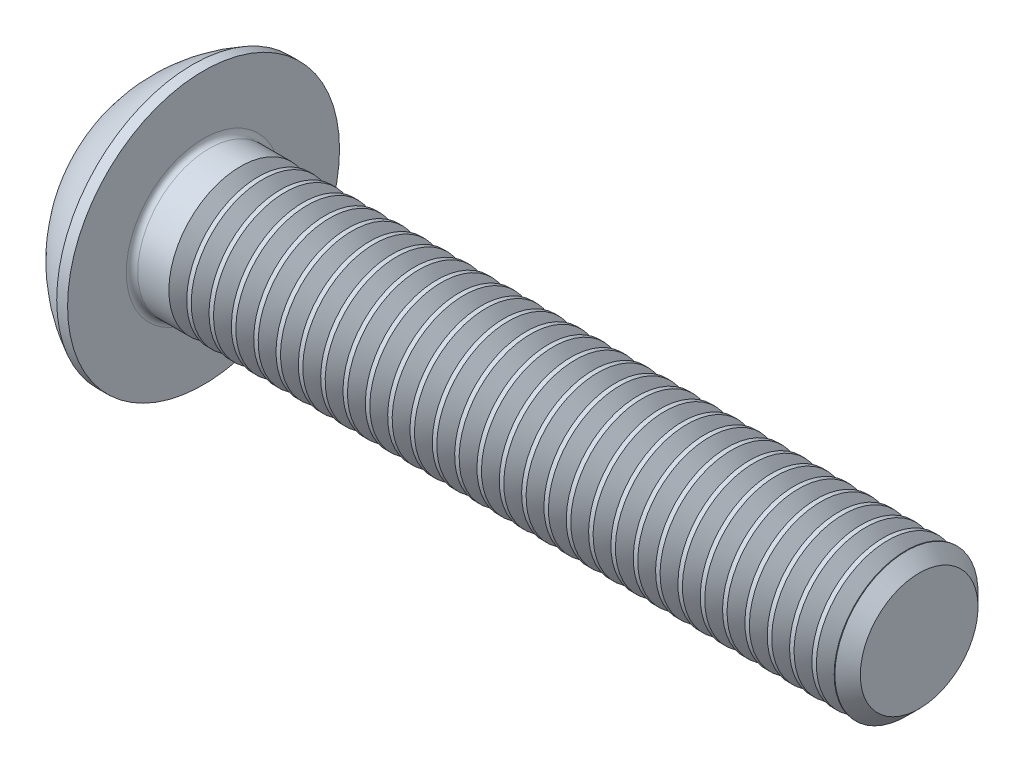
ISO-10303-21;
HEADER;
FILE_DESCRIPTION(('STEP AP214'),'2;1');
FILE_NAME('part.step','',(''),(''),'','','');
FILE_SCHEMA(('AUTOMOTIVE_DESIGN { 1 0 10303 214 1 1 1 1 }'));
ENDSEC;
DATA;
#1=APPLICATION_CONTEXT('core data for automotive mechanical design processes');
#2=APPLICATION_PROTOCOL_DEFINITION('international standard','automotive_design',2000,#1);
#3=PRODUCT_CONTEXT('',#1,'mechanical');
#4=PRODUCT('Part','Part','',(#3));
#5=PRODUCT_RELATED_PRODUCT_CATEGORY('part','',(#4));
#6=PRODUCT_DEFINITION_FORMATION('','',#4);
#7=PRODUCT_DEFINITION_CONTEXT('part definition',#1,'design');
#8=PRODUCT_DEFINITION('design','',#6,#7);
#9=PRODUCT_DEFINITION_SHAPE('','',#8);
#10=(LENGTH_UNIT() NAMED_UNIT(*) SI_UNIT(.MILLI.,.METRE.));
#11=(NAMED_UNIT(*) PLANE_ANGLE_UNIT() SI_UNIT($,.RADIAN.));
#12=(NAMED_UNIT(*) SI_UNIT($,.STERADIAN.) SOLID_ANGLE_UNIT());
#13=UNCERTAINTY_MEASURE_WITH_UNIT(LENGTH_MEASURE(1.E-05),#10,'distance_accuracy_value','');
#14=(GEOMETRIC_REPRESENTATION_CONTEXT(3) GLOBAL_UNCERTAINTY_ASSIGNED_CONTEXT((#13)) GLOBAL_UNIT_ASSIGNED_CONTEXT((#10,
#11,#12)) REPRESENTATION_CONTEXT('',''));
#15=CARTESIAN_POINT('',(0.,0.,0.));
#16=DIRECTION('',(0.,0.,1.));
#17=DIRECTION('',(1.,0.,0.));
#18=AXIS2_PLACEMENT_3D('',#15,#16,#17);
#19=CARTESIAN_POINT('',(0.,0.,0.));
#20=DIRECTION('',(-1.,0.,0.));
#21=DIRECTION('',(0.,0.,1.));
#22=AXIS2_PLACEMENT_3D('',#19,#20,#21);
#23=PLANE('',#22);
#24=CARTESIAN_POINT('',(0.,0.,0.));
#25=DIRECTION('',(-1.,0.,0.));
#26=DIRECTION('',(0.,0.,1.));
#27=AXIS2_PLACEMENT_3D('',#24,#25,#26);
#28=CIRCLE('',#27,2.375);
#29=CARTESIAN_POINT('',(0.,2.375,0.));
#30=VERTEX_POINT('',#29);
#31=EDGE_CURVE('E154',#30,#30,#28,.T.);
#32=ORIENTED_EDGE('',*,*,#31,.T.);
#33=EDGE_LOOP('',(#32));
#34=FACE_BOUND('',#33,.T.);
#35=DIRECTION('',(0.,-1.,0.));
#36=VECTOR('',#35,1.);
#37=CARTESIAN_POINT('',(0.,-0.866025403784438,1.5));
#38=LINE('',#37,#36);
#39=CARTESIAN_POINT('',(0.,0.86602540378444,1.5));
#40=VERTEX_POINT('',#39);
#41=CARTESIAN_POINT('',(0.,-0.866025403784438,1.5));
#42=VERTEX_POINT('',#41);
#43=EDGE_CURVE('E49',#40,#42,#38,.T.);
#44=ORIENTED_EDGE('',*,*,#43,.T.);
#45=DIRECTION('',(0.,-0.5,-0.866025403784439));
#46=VECTOR('',#45,1.);
#47=CARTESIAN_POINT('',(0.,-1.73205080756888,0.));
#48=LINE('',#47,#46);
#49=CARTESIAN_POINT('',(0.,-1.73205080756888,0.));
#50=VERTEX_POINT('',#49);
#51=EDGE_CURVE('E767',#42,#50,#48,.T.);
#52=ORIENTED_EDGE('',*,*,#51,.T.);
#53=DIRECTION('',(0.,0.5,-0.866025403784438));
#54=VECTOR('',#53,1.);
#55=CARTESIAN_POINT('',(0.,-0.866025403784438,-1.5));
#56=LINE('',#55,#54);
#57=CARTESIAN_POINT('',(0.,-0.866025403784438,-1.5));
#58=VERTEX_POINT('',#57);
#59=EDGE_CURVE('E129',#50,#58,#56,.T.);
#60=ORIENTED_EDGE('',*,*,#59,.T.);
#61=DIRECTION('',(0.,1.,0.));
#62=VECTOR('',#61,1.);
#63=CARTESIAN_POINT('',(0.,0.86602540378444,-1.5));
#64=LINE('',#63,#62);
#65=CARTESIAN_POINT('',(0.,0.86602540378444,-1.5));
#66=VERTEX_POINT('',#65);
#67=EDGE_CURVE('E787',#58,#66,#64,.T.);
#68=ORIENTED_EDGE('',*,*,#67,.T.);
#69=DIRECTION('',(0.,0.5,0.866025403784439));
#70=VECTOR('',#69,1.);
#71=CARTESIAN_POINT('',(0.,1.73205080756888,0.));
#72=LINE('',#71,#70);
#73=CARTESIAN_POINT('',(0.,1.73205080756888,0.));
#74=VERTEX_POINT('',#73);
#75=EDGE_CURVE('E789',#66,#74,#72,.T.);
#76=ORIENTED_EDGE('',*,*,#75,.T.);
#77=DIRECTION('',(0.,-0.5,0.866025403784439));
#78=VECTOR('',#77,1.);
#79=CARTESIAN_POINT('',(0.,0.86602540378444,1.5));
#80=LINE('',#79,#78);
#81=EDGE_CURVE('E791',#74,#40,#80,.T.);
#82=ORIENTED_EDGE('',*,*,#81,.T.);
#83=EDGE_LOOP('',(#44,#52,#60,#68,#76,#82));
#84=FACE_BOUND('',#83,.T.);
#85=ADVANCED_FACE('F34',(#34,#84),#23,.T.);
#86=CARTESIAN_POINT('',(4.75501582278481,0.,0.));
#87=DIRECTION('',(-1.,0.,0.));
#88=DIRECTION('',(0.,1.,0.));
#89=AXIS2_PLACEMENT_3D('',#86,#87,#88);
#90=SPHERICAL_SURFACE('',#89,5.3151482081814);
#91=CARTESIAN_POINT('',(2.37,0.,0.));
#92=DIRECTION('',(-1.,0.,0.));
#93=DIRECTION('',(0.,0.,1.));
#94=AXIS2_PLACEMENT_3D('',#91,#92,#93);
#95=CIRCLE('',#94,4.75);
#96=CARTESIAN_POINT('',(2.37,4.75,0.));
#97=VERTEX_POINT('',#96);
#98=EDGE_CURVE('E151',#97,#97,#95,.T.);
#99=CARTESIAN_POINT('',(2.37,4.75,0.));
#100=CARTESIAN_POINT('',(2.33822259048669,4.7340443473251,0.));
#101=CARTESIAN_POINT('',(2.30660534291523,4.71776971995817,0.));
#102=CARTESIAN_POINT('',(2.24370380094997,4.68458927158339,0.));
#103=CARTESIAN_POINT('',(2.21241950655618,4.66768345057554,0.));
#104=CARTESIAN_POINT('',(2.15019650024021,4.6332473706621,0.));
#105=CARTESIAN_POINT('',(2.11925778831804,4.6157171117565,0.));
#106=CARTESIAN_POINT('',(2.05773840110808,4.58003923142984,0.));
#107=CARTESIAN_POINT('',(2.02715772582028,4.56189161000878,0.));
#108=CARTESIAN_POINT('',(1.96636673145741,4.52498631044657,0.));
#109=CARTESIAN_POINT('',(1.93615641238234,4.50622863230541,0.));
#110=CARTESIAN_POINT('',(1.87611829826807,4.46811077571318,0.));
#111=CARTESIAN_POINT('',(1.84629050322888,4.4487505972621,0.));
#112=CARTESIAN_POINT('',(1.78702945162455,4.40943553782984,0.));
#113=CARTESIAN_POINT('',(1.75759619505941,4.38948065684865,0.));
#114=CARTESIAN_POINT('',(1.69913607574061,4.34898423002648,0.));
#115=CARTESIAN_POINT('',(1.67010921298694,4.32844268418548,0.));
#116=CARTESIAN_POINT('',(1.61247357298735,4.28678120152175,0.));
#117=CARTESIAN_POINT('',(1.58386479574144,4.265661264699,0.));
#118=CARTESIAN_POINT('',(1.52707685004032,4.22285150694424,0.));
#119=CARTESIAN_POINT('',(1.49889768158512,4.20116168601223,0.));
#120=CARTESIAN_POINT('',(1.44298030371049,4.15722089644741,0.));
#121=CARTESIAN_POINT('',(1.41524209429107,4.13496992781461,0.));
#122=CARTESIAN_POINT('',(1.36021780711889,4.08991580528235,0.));
#123=CARTESIAN_POINT('',(1.33293172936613,4.06711265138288,0.));
#124=CARTESIAN_POINT('',(1.278822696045,4.02096334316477,0.));
#125=CARTESIAN_POINT('',(1.25199974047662,3.99761718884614,0.));
#126=CARTESIAN_POINT('',(1.19882775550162,3.95039128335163,0.));
#127=CARTESIAN_POINT('',(1.172478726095,3.92651153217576,0.));
#128=CARTESIAN_POINT('',(1.1202652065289,3.87822805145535,0.));
#129=CARTESIAN_POINT('',(1.09440071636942,3.85382432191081,0.));
#130=CARTESIAN_POINT('',(1.04316669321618,3.8045027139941,0.));
#131=CARTESIAN_POINT('',(1.01779716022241,3.77958483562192,0.));
#132=CARTESIAN_POINT('',(0.9675632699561,3.72924496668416,0.));
#133=CARTESIAN_POINT('',(0.942698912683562,3.70382297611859,0.));
#134=CARTESIAN_POINT('',(0.89348538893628,3.65248512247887,0.));
#135=CARTESIAN_POINT('',(0.869136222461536,3.62656925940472,0.));
#136=CARTESIAN_POINT('',(0.82096288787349,3.57425409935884,0.));
#137=CARTESIAN_POINT('',(0.797138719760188,3.54785480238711,0.));
#138=CARTESIAN_POINT('',(0.750024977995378,3.49458340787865,0.));
#139=CARTESIAN_POINT('',(0.726735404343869,3.46771131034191,0.));
#140=CARTESIAN_POINT('',(0.680700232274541,3.41350513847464,0.));
#141=CARTESIAN_POINT('',(0.657954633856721,3.3861710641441,0.));
#142=CARTESIAN_POINT('',(0.613016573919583,3.33105194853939,0.));
#143=CARTESIAN_POINT('',(0.590824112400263,3.30326690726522,0.));
#144=CARTESIAN_POINT('',(0.547001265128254,3.24725704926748,0.));
#145=CARTESIAN_POINT('',(0.525370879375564,3.21903223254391,0.));
#146=CARTESIAN_POINT('',(0.48268089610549,3.16215419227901,0.));
#147=CARTESIAN_POINT('',(0.461621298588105,3.13350096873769,0.));
#148=CARTESIAN_POINT('',(0.420081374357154,3.07577765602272,0.));
#149=CARTESIAN_POINT('',(0.399601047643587,3.04670756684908,0.));
#150=CARTESIAN_POINT('',(0.359227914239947,2.98816223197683,0.));
#151=CARTESIAN_POINT('',(0.339335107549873,2.95868698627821,0.));
#152=CARTESIAN_POINT('',(0.300145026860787,2.89934321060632,0.));
#153=CARTESIAN_POINT('',(0.280847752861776,2.86947468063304,0.));
#154=CARTESIAN_POINT('',(0.242856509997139,2.80935636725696,0.));
#155=CARTESIAN_POINT('',(0.224162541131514,2.77910658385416,0.));
#156=CARTESIAN_POINT('',(0.187385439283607,2.71823794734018,0.));
#157=CARTESIAN_POINT('',(0.169302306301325,2.68761909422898,0.));
#158=CARTESIAN_POINT('',(0.133754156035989,2.626024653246,0.));
#159=CARTESIAN_POINT('',(0.116289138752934,2.59504906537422,0.));
#160=CARTESIAN_POINT('',(0.081984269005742,2.53275362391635,0.));
#161=CARTESIAN_POINT('',(0.0651444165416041,2.50143377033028,0.));
#162=CARTESIAN_POINT('',(0.03209660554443,2.43846244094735,0.));
#163=CARTESIAN_POINT('',(0.0158886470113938,2.40681096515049,0.));
#164=CARTESIAN_POINT('',(0.,2.375,0.));
#165=B_SPLINE_CURVE_WITH_KNOTS('',3,(#99,#100,#101,#102,#103,#104,#105,#106,#107,#108,#109,#110,
#111,#112,#113,#114,#115,#116,#117,#118,#119,#120,#121,#122,#123,#124,#125,#126,#127,#128,#129,
#130,#131,#132,#133,#134,#135,#136,#137,#138,#139,#140,#141,#142,#143,#144,#145,#146,#147,#148,
#149,#150,#151,#152,#153,#154,#155,#156,#157,#158,#159,#160,#161,#162,#163,#164),.UNSPECIFIED.,
.F.,.F.,(4,2,2,2,2,2,2,2,2,2,2,2,2,2,2,2,2,2,2,2,2,2,2,2,2,2,2,2,2,2,2,2,4),(0.,
0.106672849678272,0.213345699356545,0.320018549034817,0.426691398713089,0.533364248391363,
0.640037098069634,0.746709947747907,0.853382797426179,0.960055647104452,1.06672849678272,
1.173401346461,1.28007419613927,1.38674704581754,1.49341989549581,1.60009274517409,
1.70676559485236,1.81343844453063,1.9201112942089,2.02678414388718,2.13345699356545,
2.24012984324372,2.34680269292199,2.45347554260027,2.56014839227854,2.66682124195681,
2.77349409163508,2.88016694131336,2.98683979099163,3.0935126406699,3.20018549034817,
3.30685834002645,3.41353118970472),.UNSPECIFIED.);
#166=EDGE_CURVE('BSEAM176',#97,#30,#165,.T.);
#167=ORIENTED_EDGE('',*,*,#98,.T.);
#168=ORIENTED_EDGE('',*,*,#31,.F.);
#169=ORIENTED_EDGE('',*,*,#166,.T.);
#170=ORIENTED_EDGE('',*,*,#166,.F.);
#171=EDGE_LOOP('',(#167,#169,#168,#170));
#172=FACE_BOUND('',#171,.T.);
#173=ADVANCED_FACE('F176',(#172),#90,.T.);
#174=CARTESIAN_POINT('',(0.,0.,0.));
#175=DIRECTION('',(-1.,0.,0.));
#176=DIRECTION('',(0.,0.,1.));
#177=AXIS2_PLACEMENT_3D('',#174,#175,#176);
#178=CYLINDRICAL_SURFACE('',#177,4.75);
#179=ORIENTED_EDGE('',*,*,#98,.F.);
#180=EDGE_LOOP('',(#179));
#181=FACE_BOUND('',#180,.T.);
#182=CARTESIAN_POINT('',(2.75,0.,0.));
#183=DIRECTION('',(-1.,0.,0.));
#184=DIRECTION('',(0.,0.,1.));
#185=AXIS2_PLACEMENT_3D('',#182,#183,#184);
#186=CIRCLE('',#185,4.75);
#187=CARTESIAN_POINT('',(2.75,0.,4.75));
#188=VERTEX_POINT('',#187);
#189=EDGE_CURVE('E148',#188,#188,#186,.T.);
#190=ORIENTED_EDGE('',*,*,#189,.T.);
#191=EDGE_LOOP('',(#190));
#192=FACE_BOUND('',#191,.T.);
#193=ADVANCED_FACE('F181',(#181,#192),#178,.T.);
#194=CARTESIAN_POINT('',(2.75,2.49999999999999,0.));
#195=DIRECTION('',(-1.,0.,0.));
#196=DIRECTION('',(0.,0.,1.));
#197=AXIS2_PLACEMENT_3D('',#194,#195,#196);
#198=PLANE('',#197);
#199=CARTESIAN_POINT('',(2.75,0.,0.));
#200=DIRECTION('',(-1.,0.,0.));
#201=DIRECTION('',(0.,0.,1.));
#202=AXIS2_PLACEMENT_3D('',#199,#200,#201);
#203=CIRCLE('',#202,2.7);
#204=CARTESIAN_POINT('',(2.75,0.,2.7));
#205=VERTEX_POINT('',#204);
#206=EDGE_CURVE('E42',#205,#205,#203,.T.);
#207=ORIENTED_EDGE('',*,*,#206,.T.);
#208=EDGE_LOOP('',(#207));
#209=FACE_BOUND('',#208,.T.);
#210=ORIENTED_EDGE('',*,*,#189,.F.);
#211=EDGE_LOOP('',(#210));
#212=FACE_BOUND('',#211,.T.);
#213=ADVANCED_FACE('F159',(#209,#212),#198,.F.);
#214=CARTESIAN_POINT('',(0.,0.,0.));
#215=DIRECTION('',(-1.,0.,0.));
#216=DIRECTION('',(0.,0.,1.));
#217=AXIS2_PLACEMENT_3D('',#214,#215,#216);
#218=CYLINDRICAL_SURFACE('',#217,2.5);
#219=CARTESIAN_POINT('',(4.03840764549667,0.,0.));
#220=DIRECTION('',(-1.,0.,0.));
#221=DIRECTION('',(0.,-1.,0.));
#222=AXIS2_PLACEMENT_3D('',#219,#220,#221);
#223=CIRCLE('',#222,2.5);
#224=CARTESIAN_POINT('',(4.03840764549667,-2.5,0.));
#225=VERTEX_POINT('',#224);
#226=EDGE_CURVE('E762',#225,#225,#223,.T.);
#227=ORIENTED_EDGE('',*,*,#226,.T.);
#228=EDGE_LOOP('',(#227));
#229=FACE_BOUND('',#228,.T.);
#230=CARTESIAN_POINT('',(2.95,0.,0.));
#231=DIRECTION('',(-1.,0.,0.));
#232=DIRECTION('',(0.,0.,1.));
#233=AXIS2_PLACEMENT_3D('',#230,#231,#232);
#234=CIRCLE('',#233,2.5);
#235=CARTESIAN_POINT('',(2.95,0.,2.5));
#236=VERTEX_POINT('',#235);
#237=EDGE_CURVE('E11',#236,#236,#234,.F.);
#238=ORIENTED_EDGE('',*,*,#237,.T.);
#239=EDGE_LOOP('',(#238));
#240=FACE_BOUND('',#239,.T.);
#241=ADVANCED_FACE('F163',(#229,#240),#218,.T.);
#242=CARTESIAN_POINT('',(2.95,0.,0.));
#243=DIRECTION('',(-1.,0.,0.));
#244=DIRECTION('',(0.,0.,1.));
#245=AXIS2_PLACEMENT_3D('',#242,#243,#244);
#246=TOROIDAL_SURFACE('',#245,2.7,0.2);
#247=ORIENTED_EDGE('',*,*,#237,.F.);
#248=EDGE_LOOP('',(#247));
#249=FACE_BOUND('',#248,.T.);
#250=ORIENTED_EDGE('',*,*,#206,.F.);
#251=EDGE_LOOP('',(#250));
#252=FACE_BOUND('',#251,.T.);
#253=ADVANCED_FACE('F36',(#249,#252),#246,.F.);
#254=CARTESIAN_POINT('',(1.56,-1.73205080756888,0.));
#255=DIRECTION('',(0.,0.866025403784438,-0.5));
#256=DIRECTION('',(0.,0.5,0.866025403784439));
#257=AXIS2_PLACEMENT_3D('',#254,#255,#256);
#258=PLANE('',#257);
#259=DIRECTION('',(0.,-0.5,-0.866025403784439));
#260=VECTOR('',#259,1.);
#261=CARTESIAN_POINT('',(1.56,-1.73205080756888,0.));
#262=LINE('',#261,#260);
#263=CARTESIAN_POINT('',(1.56,-0.866025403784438,1.5));
#264=VERTEX_POINT('',#263);
#265=CARTESIAN_POINT('',(1.56,-1.29903810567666,0.75));
#266=VERTEX_POINT('',#265);
#267=EDGE_CURVE('E115',#264,#266,#262,.T.);
#268=ORIENTED_EDGE('',*,*,#267,.T.);
#269=CARTESIAN_POINT('',(1.56,-1.73205080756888,0.));
#270=VERTEX_POINT('',#269);
#271=EDGE_CURVE('E110',#266,#270,#262,.T.);
#272=ORIENTED_EDGE('',*,*,#271,.T.);
#273=DIRECTION('',(-1.,0.,0.));
#274=VECTOR('',#273,1.);
#275=CARTESIAN_POINT('',(1.56,-1.73205080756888,0.));
#276=LINE('',#275,#274);
#277=EDGE_CURVE('E112',#270,#50,#276,.T.);
#278=ORIENTED_EDGE('',*,*,#277,.T.);
#279=ORIENTED_EDGE('',*,*,#51,.F.);
#280=DIRECTION('',(-1.,0.,0.));
#281=VECTOR('',#280,1.);
#282=CARTESIAN_POINT('',(1.56,-0.866025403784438,1.5));
#283=LINE('',#282,#281);
#284=EDGE_CURVE('E784',#264,#42,#283,.T.);
#285=ORIENTED_EDGE('',*,*,#284,.F.);
#286=EDGE_LOOP('',(#268,#272,#278,#279,#285));
#287=FACE_BOUND('',#286,.T.);
#288=ADVANCED_FACE('F111',(#287),#258,.T.);
#289=CARTESIAN_POINT('',(1.56,-0.866025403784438,-1.5));
#290=DIRECTION('',(0.,0.866025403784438,0.5));
#291=DIRECTION('',(0.,-0.5,0.866025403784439));
#292=AXIS2_PLACEMENT_3D('',#289,#290,#291);
#293=PLANE('',#292);
#294=DIRECTION('',(0.,0.5,-0.866025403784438));
#295=VECTOR('',#294,1.);
#296=CARTESIAN_POINT('',(1.56,-0.866025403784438,-1.5));
#297=LINE('',#296,#295);
#298=CARTESIAN_POINT('',(1.56,-1.29903810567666,-0.75));
#299=VERTEX_POINT('',#298);
#300=EDGE_CURVE('E57',#270,#299,#297,.T.);
#301=ORIENTED_EDGE('',*,*,#300,.T.);
#302=CARTESIAN_POINT('',(1.56,-0.866025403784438,-1.5));
#303=VERTEX_POINT('',#302);
#304=EDGE_CURVE('E124',#299,#303,#297,.T.);
#305=ORIENTED_EDGE('',*,*,#304,.T.);
#306=DIRECTION('',(-1.,0.,0.));
#307=VECTOR('',#306,1.);
#308=CARTESIAN_POINT('',(1.56,-0.866025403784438,-1.5));
#309=LINE('',#308,#307);
#310=EDGE_CURVE('E131',#303,#58,#309,.T.);
#311=ORIENTED_EDGE('',*,*,#310,.T.);
#312=ORIENTED_EDGE('',*,*,#59,.F.);
#313=ORIENTED_EDGE('',*,*,#277,.F.);
#314=EDGE_LOOP('',(#301,#305,#311,#312,#313));
#315=FACE_BOUND('',#314,.T.);
#316=ADVANCED_FACE('F127',(#315),#293,.T.);
#317=CARTESIAN_POINT('',(1.56,0.86602540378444,-1.5));
#318=DIRECTION('',(0.,0.,1.));
#319=DIRECTION('',(1.,0.,0.));
#320=AXIS2_PLACEMENT_3D('',#317,#318,#319);
#321=PLANE('',#320);
#322=DIRECTION('',(0.,1.,0.));
#323=VECTOR('',#322,1.);
#324=CARTESIAN_POINT('',(1.56,0.86602540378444,-1.5));
#325=LINE('',#324,#323);
#326=CARTESIAN_POINT('',(1.56,0.,-1.5));
#327=VERTEX_POINT('',#326);
#328=EDGE_CURVE('E769',#303,#327,#325,.T.);
#329=ORIENTED_EDGE('',*,*,#328,.T.);
#330=CARTESIAN_POINT('',(1.56,0.86602540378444,-1.5));
#331=VERTEX_POINT('',#330);
#332=EDGE_CURVE('E123',#327,#331,#325,.T.);
#333=ORIENTED_EDGE('',*,*,#332,.T.);
#334=DIRECTION('',(-1.,0.,0.));
#335=VECTOR('',#334,1.);
#336=CARTESIAN_POINT('',(1.56,0.86602540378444,-1.5));
#337=LINE('',#336,#335);
#338=EDGE_CURVE('E136',#331,#66,#337,.T.);
#339=ORIENTED_EDGE('',*,*,#338,.T.);
#340=ORIENTED_EDGE('',*,*,#67,.F.);
#341=ORIENTED_EDGE('',*,*,#310,.F.);
#342=EDGE_LOOP('',(#329,#333,#339,#340,#341));
#343=FACE_BOUND('',#342,.T.);
#344=ADVANCED_FACE('F207',(#343),#321,.T.);
#345=CARTESIAN_POINT('',(1.56,1.73205080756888,0.));
#346=DIRECTION('',(0.,-0.866025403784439,0.5));
#347=DIRECTION('',(0.,-0.5,-0.866025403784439));
#348=AXIS2_PLACEMENT_3D('',#345,#346,#347);
#349=PLANE('',#348);
#350=DIRECTION('',(0.,0.5,0.866025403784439));
#351=VECTOR('',#350,1.);
#352=CARTESIAN_POINT('',(1.56,1.73205080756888,0.));
#353=LINE('',#352,#351);
#354=CARTESIAN_POINT('',(1.56,1.29903810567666,-0.750000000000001));
#355=VERTEX_POINT('',#354);
#356=EDGE_CURVE('E773',#331,#355,#353,.T.);
#357=ORIENTED_EDGE('',*,*,#356,.T.);
#358=CARTESIAN_POINT('',(1.56,1.73205080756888,0.));
#359=VERTEX_POINT('',#358);
#360=EDGE_CURVE('E772',#355,#359,#353,.T.);
#361=ORIENTED_EDGE('',*,*,#360,.T.);
#362=DIRECTION('',(-1.,0.,0.));
#363=VECTOR('',#362,1.);
#364=CARTESIAN_POINT('',(1.56,1.73205080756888,0.));
#365=LINE('',#364,#363);
#366=EDGE_CURVE('E799',#359,#74,#365,.T.);
#367=ORIENTED_EDGE('',*,*,#366,.T.);
#368=ORIENTED_EDGE('',*,*,#75,.F.);
#369=ORIENTED_EDGE('',*,*,#338,.F.);
#370=EDGE_LOOP('',(#357,#361,#367,#368,#369));
#371=FACE_BOUND('',#370,.T.);
#372=ADVANCED_FACE('F210',(#371),#349,.T.);
#373=CARTESIAN_POINT('',(1.56,0.86602540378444,1.5));
#374=DIRECTION('',(0.,-0.866025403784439,-0.5));
#375=DIRECTION('',(0.,0.5,-0.866025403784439));
#376=AXIS2_PLACEMENT_3D('',#373,#374,#375);
#377=PLANE('',#376);
#378=DIRECTION('',(0.,-0.5,0.866025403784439));
#379=VECTOR('',#378,1.);
#380=CARTESIAN_POINT('',(1.56,0.86602540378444,1.5));
#381=LINE('',#380,#379);
#382=CARTESIAN_POINT('',(1.56,1.29903810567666,0.75));
#383=VERTEX_POINT('',#382);
#384=EDGE_CURVE('E777',#359,#383,#381,.T.);
#385=ORIENTED_EDGE('',*,*,#384,.T.);
#386=CARTESIAN_POINT('',(1.56,0.86602540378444,1.5));
#387=VERTEX_POINT('',#386);
#388=EDGE_CURVE('E776',#383,#387,#381,.T.);
#389=ORIENTED_EDGE('',*,*,#388,.T.);
#390=DIRECTION('',(-1.,0.,0.));
#391=VECTOR('',#390,1.);
#392=CARTESIAN_POINT('',(1.56,0.86602540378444,1.5));
#393=LINE('',#392,#391);
#394=EDGE_CURVE('E796',#387,#40,#393,.T.);
#395=ORIENTED_EDGE('',*,*,#394,.T.);
#396=ORIENTED_EDGE('',*,*,#81,.F.);
#397=ORIENTED_EDGE('',*,*,#366,.F.);
#398=EDGE_LOOP('',(#385,#389,#395,#396,#397));
#399=FACE_BOUND('',#398,.T.);
#400=ADVANCED_FACE('F214',(#399),#377,.T.);
#401=CARTESIAN_POINT('',(1.56,-0.866025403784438,1.5));
#402=DIRECTION('',(0.,0.,-1.));
#403=DIRECTION('',(0.,1.,0.));
#404=AXIS2_PLACEMENT_3D('',#401,#402,#403);
#405=PLANE('',#404);
#406=DIRECTION('',(0.,-1.,0.));
#407=VECTOR('',#406,1.);
#408=CARTESIAN_POINT('',(1.56,-0.866025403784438,1.5));
#409=LINE('',#408,#407);
#410=CARTESIAN_POINT('',(1.56,0.,1.5));
#411=VERTEX_POINT('',#410);
#412=EDGE_CURVE('E781',#387,#411,#409,.T.);
#413=ORIENTED_EDGE('',*,*,#412,.T.);
#414=EDGE_CURVE('E780',#411,#264,#409,.T.);
#415=ORIENTED_EDGE('',*,*,#414,.T.);
#416=ORIENTED_EDGE('',*,*,#284,.T.);
#417=ORIENTED_EDGE('',*,*,#43,.F.);
#418=ORIENTED_EDGE('',*,*,#394,.F.);
#419=EDGE_LOOP('',(#413,#415,#416,#417,#418));
#420=FACE_BOUND('',#419,.T.);
#421=ADVANCED_FACE('F218',(#420),#405,.T.);
#422=CARTESIAN_POINT('',(1.56,-1.73205080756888,0.));
#423=DIRECTION('',(1.,0.,0.));
#424=DIRECTION('',(0.,0.,-1.));
#425=AXIS2_PLACEMENT_3D('',#422,#423,#424);
#426=PLANE('',#425);
#427=CARTESIAN_POINT('',(1.56,0.,0.));
#428=DIRECTION('',(-1.,0.,0.));
#429=DIRECTION('',(0.,0.,1.));
#430=AXIS2_PLACEMENT_3D('',#427,#428,#429);
#431=CIRCLE('',#430,1.5);
#432=EDGE_CURVE('E813',#355,#327,#431,.T.);
#433=ORIENTED_EDGE('',*,*,#432,.F.);
#434=ORIENTED_EDGE('',*,*,#356,.F.);
#435=ORIENTED_EDGE('',*,*,#332,.F.);
#436=EDGE_LOOP('',(#433,#434,#435));
#437=FACE_BOUND('',#436,.T.);
#438=ADVANCED_FACE('F222',(#437),#426,.F.);
#439=EDGE_CURVE('E142',#383,#355,#431,.T.);
#440=ORIENTED_EDGE('',*,*,#439,.F.);
#441=ORIENTED_EDGE('',*,*,#384,.F.);
#442=ORIENTED_EDGE('',*,*,#360,.F.);
#443=EDGE_LOOP('',(#440,#441,#442));
#444=FACE_BOUND('',#443,.T.);
#445=ADVANCED_FACE('F821',(#444),#426,.F.);
#446=EDGE_CURVE('E135',#411,#383,#431,.T.);
#447=ORIENTED_EDGE('',*,*,#446,.F.);
#448=ORIENTED_EDGE('',*,*,#412,.F.);
#449=ORIENTED_EDGE('',*,*,#388,.F.);
#450=EDGE_LOOP('',(#447,#448,#449));
#451=FACE_BOUND('',#450,.T.);
#452=ADVANCED_FACE('F824',(#451),#426,.F.);
#453=EDGE_CURVE('E130',#266,#411,#431,.T.);
#454=ORIENTED_EDGE('',*,*,#453,.F.);
#455=ORIENTED_EDGE('',*,*,#267,.F.);
#456=ORIENTED_EDGE('',*,*,#414,.F.);
#457=EDGE_LOOP('',(#454,#455,#456));
#458=FACE_BOUND('',#457,.T.);
#459=ADVANCED_FACE('F828',(#458),#426,.F.);
#460=EDGE_CURVE('E121',#299,#266,#431,.T.);
#461=ORIENTED_EDGE('',*,*,#460,.F.);
#462=ORIENTED_EDGE('',*,*,#300,.F.);
#463=ORIENTED_EDGE('',*,*,#271,.F.);
#464=EDGE_LOOP('',(#461,#462,#463));
#465=FACE_BOUND('',#464,.T.);
#466=ADVANCED_FACE('F120',(#465),#426,.F.);
#467=EDGE_CURVE('E812',#327,#299,#431,.T.);
#468=ORIENTED_EDGE('',*,*,#467,.F.);
#469=ORIENTED_EDGE('',*,*,#328,.F.);
#470=ORIENTED_EDGE('',*,*,#304,.F.);
#471=EDGE_LOOP('',(#468,#469,#470));
#472=FACE_BOUND('',#471,.T.);
#473=ADVANCED_FACE('F202',(#472),#426,.F.);
#474=CARTESIAN_POINT('',(2.42602540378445,0.,0.));
#475=DIRECTION('',(-1.,0.,0.));
#476=DIRECTION('',(0.,0.,1.));
#477=AXIS2_PLACEMENT_3D('',#474,#475,#476);
#478=CONICAL_SURFACE('',#477,0.,1.04719755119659);
#479=ORIENTED_EDGE('',*,*,#446,.T.);
#480=ORIENTED_EDGE('',*,*,#439,.T.);
#481=ORIENTED_EDGE('',*,*,#432,.T.);
#482=ORIENTED_EDGE('',*,*,#467,.T.);
#483=ORIENTED_EDGE('',*,*,#460,.T.);
#484=ORIENTED_EDGE('',*,*,#453,.T.);
#485=EDGE_LOOP('',(#479,#480,#481,#482,#483,#484));
#486=FACE_BOUND('',#485,.T.);
#487=CARTESIAN_POINT('',(2.42602540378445,0.,0.));
#488=VERTEX_POINT('',#487);
#489=VERTEX_LOOP('',#488);
#490=FACE_BOUND('',#489,.T.);
#491=ADVANCED_FACE('F199',(#486,#490),#478,.F.);
#492=CARTESIAN_POINT('',(4.66159235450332,0.,0.));
#493=DIRECTION('',(1.,0.,0.));
#494=DIRECTION('',(0.,1.,0.));
#495=AXIS2_PLACEMENT_3D('',#492,#493,#494);
#496=CONICAL_SURFACE('',#495,2.5,0.959931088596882);
#497=CARTESIAN_POINT('',(4.35,0.,0.));
#498=DIRECTION('',(-1.,0.,0.));
#499=DIRECTION('',(0.,-1.,0.));
#500=AXIS2_PLACEMENT_3D('',#497,#498,#499);
#501=CIRCLE('',#500,2.055);
#502=CARTESIAN_POINT('',(4.35,-2.055,0.));
#503=VERTEX_POINT('',#502);
#504=EDGE_CURVE('E759',#503,#503,#501,.T.);
#505=ORIENTED_EDGE('',*,*,#504,.F.);
#506=EDGE_LOOP('',(#505));
#507=FACE_BOUND('',#506,.T.);
#508=CARTESIAN_POINT('',(4.66159235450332,0.,0.));
#509=DIRECTION('',(-1.,0.,0.));
#510=DIRECTION('',(0.,-1.,0.));
#511=AXIS2_PLACEMENT_3D('',#508,#509,#510);
#512=CIRCLE('',#511,2.5);
#513=CARTESIAN_POINT('',(4.66159235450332,-2.5,0.));
#514=VERTEX_POINT('',#513);
#515=EDGE_CURVE('E765',#514,#514,#512,.T.);
#516=ORIENTED_EDGE('',*,*,#515,.T.);
#517=EDGE_LOOP('',(#516));
#518=FACE_BOUND('',#517,.T.);
#519=ADVANCED_FACE('F201',(#507,#518),#496,.T.);
#520=CARTESIAN_POINT('',(4.35,0.,0.));
#521=DIRECTION('',(-1.,0.,0.));
#522=DIRECTION('',(0.,-1.,0.));
#523=AXIS2_PLACEMENT_3D('',#520,#521,#522);
#524=CONICAL_SURFACE('',#523,2.055,0.959931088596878);
#525=ORIENTED_EDGE('',*,*,#226,.F.);
#526=EDGE_LOOP('',(#525));
#527=FACE_BOUND('',#526,.T.);
#528=ORIENTED_EDGE('',*,*,#504,.T.);
#529=EDGE_LOOP('',(#528));
#530=FACE_BOUND('',#529,.T.);
#531=ADVANCED_FACE('F229',(#527,#530),#524,.T.);
#532=CARTESIAN_POINT('',(4.81840764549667,0.,0.));
#533=DIRECTION('',(-1.,0.,0.));
#534=DIRECTION('',(0.,-1.,0.));
#535=AXIS2_PLACEMENT_3D('',#532,#533,#534);
#536=CIRCLE('',#535,2.5);
#537=CARTESIAN_POINT('',(4.81840764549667,-2.5,0.));
#538=VERTEX_POINT('',#537);
#539=EDGE_CURVE('E753',#538,#538,#536,.T.);
#540=ORIENTED_EDGE('',*,*,#539,.T.);
#541=EDGE_LOOP('',(#540));
#542=FACE_BOUND('',#541,.T.);
#543=ORIENTED_EDGE('',*,*,#515,.F.);
#544=EDGE_LOOP('',(#543));
#545=FACE_BOUND('',#544,.T.);
#546=ADVANCED_FACE('F173',(#542,#545),#218,.T.);
#547=CARTESIAN_POINT('',(5.44159235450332,0.,0.));
#548=DIRECTION('',(1.,0.,0.));
#549=DIRECTION('',(0.,1.,0.));
#550=AXIS2_PLACEMENT_3D('',#547,#548,#549);
#551=CONICAL_SURFACE('',#550,2.5,0.959931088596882);
#552=CARTESIAN_POINT('',(5.13,0.,0.));
#553=DIRECTION('',(-1.,0.,0.));
#554=DIRECTION('',(0.,-1.,0.));
#555=AXIS2_PLACEMENT_3D('',#552,#553,#554);
#556=CIRCLE('',#555,2.055);
#557=CARTESIAN_POINT('',(5.13,-2.055,0.));
#558=VERTEX_POINT('',#557);
#559=EDGE_CURVE('E750',#558,#558,#556,.T.);
#560=ORIENTED_EDGE('',*,*,#559,.F.);
#561=EDGE_LOOP('',(#560));
#562=FACE_BOUND('',#561,.T.);
#563=CARTESIAN_POINT('',(5.44159235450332,0.,0.));
#564=DIRECTION('',(-1.,0.,0.));
#565=DIRECTION('',(0.,-1.,0.));
#566=AXIS2_PLACEMENT_3D('',#563,#564,#565);
#567=CIRCLE('',#566,2.5);
#568=CARTESIAN_POINT('',(5.44159235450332,-2.5,0.));
#569=VERTEX_POINT('',#568);
#570=EDGE_CURVE('E756',#569,#569,#567,.T.);
#571=ORIENTED_EDGE('',*,*,#570,.T.);
#572=EDGE_LOOP('',(#571));
#573=FACE_BOUND('',#572,.T.);
#574=ADVANCED_FACE('F234',(#562,#573),#551,.T.);
#575=CARTESIAN_POINT('',(5.13,0.,0.));
#576=DIRECTION('',(-1.,0.,0.));
#577=DIRECTION('',(0.,-1.,0.));
#578=AXIS2_PLACEMENT_3D('',#575,#576,#577);
#579=CONICAL_SURFACE('',#578,2.055,0.959931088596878);
#580=ORIENTED_EDGE('',*,*,#539,.F.);
#581=EDGE_LOOP('',(#580));
#582=FACE_BOUND('',#581,.T.);
#583=ORIENTED_EDGE('',*,*,#559,.T.);
#584=EDGE_LOOP('',(#583));
#585=FACE_BOUND('',#584,.T.);
#586=ADVANCED_FACE('F237',(#582,#585),#579,.T.);
#587=CARTESIAN_POINT('',(5.59840764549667,0.,0.));
#588=DIRECTION('',(-1.,0.,0.));
#589=DIRECTION('',(0.,-1.,0.));
#590=AXIS2_PLACEMENT_3D('',#587,#588,#589);
#591=CIRCLE('',#590,2.5);
#592=CARTESIAN_POINT('',(5.59840764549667,-2.5,0.));
#593=VERTEX_POINT('',#592);
#594=EDGE_CURVE('E744',#593,#593,#591,.T.);
#595=ORIENTED_EDGE('',*,*,#594,.T.);
#596=EDGE_LOOP('',(#595));
#597=FACE_BOUND('',#596,.T.);
#598=ORIENTED_EDGE('',*,*,#570,.F.);
#599=EDGE_LOOP('',(#598));
#600=FACE_BOUND('',#599,.T.);
#601=ADVANCED_FACE('F241',(#597,#600),#218,.T.);
#602=CARTESIAN_POINT('',(6.22159235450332,0.,0.));
#603=DIRECTION('',(1.,0.,0.));
#604=DIRECTION('',(0.,1.,0.));
#605=AXIS2_PLACEMENT_3D('',#602,#603,#604);
#606=CONICAL_SURFACE('',#605,2.5,0.959931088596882);
#607=CARTESIAN_POINT('',(5.91,0.,0.));
#608=DIRECTION('',(-1.,0.,0.));
#609=DIRECTION('',(0.,-1.,0.));
#610=AXIS2_PLACEMENT_3D('',#607,#608,#609);
#611=CIRCLE('',#610,2.055);
#612=CARTESIAN_POINT('',(5.91,-2.055,0.));
#613=VERTEX_POINT('',#612);
#614=EDGE_CURVE('E741',#613,#613,#611,.T.);
#615=ORIENTED_EDGE('',*,*,#614,.F.);
#616=EDGE_LOOP('',(#615));
#617=FACE_BOUND('',#616,.T.);
#618=CARTESIAN_POINT('',(6.22159235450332,0.,0.));
#619=DIRECTION('',(-1.,0.,0.));
#620=DIRECTION('',(0.,-1.,0.));
#621=AXIS2_PLACEMENT_3D('',#618,#619,#620);
#622=CIRCLE('',#621,2.5);
#623=CARTESIAN_POINT('',(6.22159235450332,-2.5,0.));
#624=VERTEX_POINT('',#623);
#625=EDGE_CURVE('E747',#624,#624,#622,.T.);
#626=ORIENTED_EDGE('',*,*,#625,.T.);
#627=EDGE_LOOP('',(#626));
#628=FACE_BOUND('',#627,.T.);
#629=ADVANCED_FACE('F243',(#617,#628),#606,.T.);
#630=CARTESIAN_POINT('',(5.91,0.,0.));
#631=DIRECTION('',(-1.,0.,0.));
#632=DIRECTION('',(0.,-1.,0.));
#633=AXIS2_PLACEMENT_3D('',#630,#631,#632);
#634=CONICAL_SURFACE('',#633,2.055,0.959931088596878);
#635=ORIENTED_EDGE('',*,*,#594,.F.);
#636=EDGE_LOOP('',(#635));
#637=FACE_BOUND('',#636,.T.);
#638=ORIENTED_EDGE('',*,*,#614,.T.);
#639=EDGE_LOOP('',(#638));
#640=FACE_BOUND('',#639,.T.);
#641=ADVANCED_FACE('F246',(#637,#640),#634,.T.);
#642=CARTESIAN_POINT('',(6.37840764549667,0.,0.));
#643=DIRECTION('',(-1.,0.,0.));
#644=DIRECTION('',(0.,-1.,0.));
#645=AXIS2_PLACEMENT_3D('',#642,#643,#644);
#646=CIRCLE('',#645,2.5);
#647=CARTESIAN_POINT('',(6.37840764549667,-2.5,0.));
#648=VERTEX_POINT('',#647);
#649=EDGE_CURVE('E735',#648,#648,#646,.T.);
#650=ORIENTED_EDGE('',*,*,#649,.T.);
#651=EDGE_LOOP('',(#650));
#652=FACE_BOUND('',#651,.T.);
#653=ORIENTED_EDGE('',*,*,#625,.F.);
#654=EDGE_LOOP('',(#653));
#655=FACE_BOUND('',#654,.T.);
#656=ADVANCED_FACE('F250',(#652,#655),#218,.T.);
#657=CARTESIAN_POINT('',(7.00159235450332,0.,0.));
#658=DIRECTION('',(1.,0.,0.));
#659=DIRECTION('',(0.,1.,0.));
#660=AXIS2_PLACEMENT_3D('',#657,#658,#659);
#661=CONICAL_SURFACE('',#660,2.5,0.959931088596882);
#662=CARTESIAN_POINT('',(6.69,0.,0.));
#663=DIRECTION('',(-1.,0.,0.));
#664=DIRECTION('',(0.,-1.,0.));
#665=AXIS2_PLACEMENT_3D('',#662,#663,#664);
#666=CIRCLE('',#665,2.055);
#667=CARTESIAN_POINT('',(6.69,-2.055,0.));
#668=VERTEX_POINT('',#667);
#669=EDGE_CURVE('E732',#668,#668,#666,.T.);
#670=ORIENTED_EDGE('',*,*,#669,.F.);
#671=EDGE_LOOP('',(#670));
#672=FACE_BOUND('',#671,.T.);
#673=CARTESIAN_POINT('',(7.00159235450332,0.,0.));
#674=DIRECTION('',(-1.,0.,0.));
#675=DIRECTION('',(0.,-1.,0.));
#676=AXIS2_PLACEMENT_3D('',#673,#674,#675);
#677=CIRCLE('',#676,2.5);
#678=CARTESIAN_POINT('',(7.00159235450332,-2.5,0.));
#679=VERTEX_POINT('',#678);
#680=EDGE_CURVE('E738',#679,#679,#677,.T.);
#681=ORIENTED_EDGE('',*,*,#680,.T.);
#682=EDGE_LOOP('',(#681));
#683=FACE_BOUND('',#682,.T.);
#684=ADVANCED_FACE('F252',(#672,#683),#661,.T.);
#685=CARTESIAN_POINT('',(6.69,0.,0.));
#686=DIRECTION('',(-1.,0.,0.));
#687=DIRECTION('',(0.,-1.,0.));
#688=AXIS2_PLACEMENT_3D('',#685,#686,#687);
#689=CONICAL_SURFACE('',#688,2.055,0.959931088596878);
#690=ORIENTED_EDGE('',*,*,#649,.F.);
#691=EDGE_LOOP('',(#690));
#692=FACE_BOUND('',#691,.T.);
#693=ORIENTED_EDGE('',*,*,#669,.T.);
#694=EDGE_LOOP('',(#693));
#695=FACE_BOUND('',#694,.T.);
#696=ADVANCED_FACE('F255',(#692,#695),#689,.T.);
#697=CARTESIAN_POINT('',(7.15840764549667,0.,0.));
#698=DIRECTION('',(-1.,0.,0.));
#699=DIRECTION('',(0.,-1.,0.));
#700=AXIS2_PLACEMENT_3D('',#697,#698,#699);
#701=CIRCLE('',#700,2.5);
#702=CARTESIAN_POINT('',(7.15840764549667,-2.5,0.));
#703=VERTEX_POINT('',#702);
#704=EDGE_CURVE('E726',#703,#703,#701,.T.);
#705=ORIENTED_EDGE('',*,*,#704,.T.);
#706=EDGE_LOOP('',(#705));
#707=FACE_BOUND('',#706,.T.);
#708=ORIENTED_EDGE('',*,*,#680,.F.);
#709=EDGE_LOOP('',(#708));
#710=FACE_BOUND('',#709,.T.);
#711=ADVANCED_FACE('F259',(#707,#710),#218,.T.);
#712=CARTESIAN_POINT('',(7.78159235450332,0.,0.));
#713=DIRECTION('',(1.,0.,0.));
#714=DIRECTION('',(0.,1.,0.));
#715=AXIS2_PLACEMENT_3D('',#712,#713,#714);
#716=CONICAL_SURFACE('',#715,2.5,0.959931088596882);
#717=CARTESIAN_POINT('',(7.47,0.,0.));
#718=DIRECTION('',(-1.,0.,0.));
#719=DIRECTION('',(0.,-1.,0.));
#720=AXIS2_PLACEMENT_3D('',#717,#718,#719);
#721=CIRCLE('',#720,2.055);
#722=CARTESIAN_POINT('',(7.47,-2.055,0.));
#723=VERTEX_POINT('',#722);
#724=EDGE_CURVE('E723',#723,#723,#721,.T.);
#725=ORIENTED_EDGE('',*,*,#724,.F.);
#726=EDGE_LOOP('',(#725));
#727=FACE_BOUND('',#726,.T.);
#728=CARTESIAN_POINT('',(7.78159235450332,0.,0.));
#729=DIRECTION('',(-1.,0.,0.));
#730=DIRECTION('',(0.,-1.,0.));
#731=AXIS2_PLACEMENT_3D('',#728,#729,#730);
#732=CIRCLE('',#731,2.5);
#733=CARTESIAN_POINT('',(7.78159235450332,-2.5,0.));
#734=VERTEX_POINT('',#733);
#735=EDGE_CURVE('E729',#734,#734,#732,.T.);
#736=ORIENTED_EDGE('',*,*,#735,.T.);
#737=EDGE_LOOP('',(#736));
#738=FACE_BOUND('',#737,.T.);
#739=ADVANCED_FACE('F261',(#727,#738),#716,.T.);
#740=CARTESIAN_POINT('',(7.47,0.,0.));
#741=DIRECTION('',(-1.,0.,0.));
#742=DIRECTION('',(0.,-1.,0.));
#743=AXIS2_PLACEMENT_3D('',#740,#741,#742);
#744=CONICAL_SURFACE('',#743,2.055,0.959931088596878);
#745=ORIENTED_EDGE('',*,*,#704,.F.);
#746=EDGE_LOOP('',(#745));
#747=FACE_BOUND('',#746,.T.);
#748=ORIENTED_EDGE('',*,*,#724,.T.);
#749=EDGE_LOOP('',(#748));
#750=FACE_BOUND('',#749,.T.);
#751=ADVANCED_FACE('F264',(#747,#750),#744,.T.);
#752=CARTESIAN_POINT('',(7.93840764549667,0.,0.));
#753=DIRECTION('',(-1.,0.,0.));
#754=DIRECTION('',(0.,-1.,0.));
#755=AXIS2_PLACEMENT_3D('',#752,#753,#754);
#756=CIRCLE('',#755,2.5);
#757=CARTESIAN_POINT('',(7.93840764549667,-2.5,0.));
#758=VERTEX_POINT('',#757);
#759=EDGE_CURVE('E717',#758,#758,#756,.T.);
#760=ORIENTED_EDGE('',*,*,#759,.T.);
#761=EDGE_LOOP('',(#760));
#762=FACE_BOUND('',#761,.T.);
#763=ORIENTED_EDGE('',*,*,#735,.F.);
#764=EDGE_LOOP('',(#763));
#765=FACE_BOUND('',#764,.T.);
#766=ADVANCED_FACE('F268',(#762,#765),#218,.T.);
#767=CARTESIAN_POINT('',(8.56159235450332,0.,0.));
#768=DIRECTION('',(1.,0.,0.));
#769=DIRECTION('',(0.,1.,0.));
#770=AXIS2_PLACEMENT_3D('',#767,#768,#769);
#771=CONICAL_SURFACE('',#770,2.5,0.959931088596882);
#772=CARTESIAN_POINT('',(8.25,0.,0.));
#773=DIRECTION('',(-1.,0.,0.));
#774=DIRECTION('',(0.,-1.,0.));
#775=AXIS2_PLACEMENT_3D('',#772,#773,#774);
#776=CIRCLE('',#775,2.055);
#777=CARTESIAN_POINT('',(8.25,-2.055,0.));
#778=VERTEX_POINT('',#777);
#779=EDGE_CURVE('E714',#778,#778,#776,.T.);
#780=ORIENTED_EDGE('',*,*,#779,.F.);
#781=EDGE_LOOP('',(#780));
#782=FACE_BOUND('',#781,.T.);
#783=CARTESIAN_POINT('',(8.56159235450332,0.,0.));
#784=DIRECTION('',(-1.,0.,0.));
#785=DIRECTION('',(0.,-1.,0.));
#786=AXIS2_PLACEMENT_3D('',#783,#784,#785);
#787=CIRCLE('',#786,2.5);
#788=CARTESIAN_POINT('',(8.56159235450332,-2.5,0.));
#789=VERTEX_POINT('',#788);
#790=EDGE_CURVE('E720',#789,#789,#787,.T.);
#791=ORIENTED_EDGE('',*,*,#790,.T.);
#792=EDGE_LOOP('',(#791));
#793=FACE_BOUND('',#792,.T.);
#794=ADVANCED_FACE('F270',(#782,#793),#771,.T.);
#795=CARTESIAN_POINT('',(8.25,0.,0.));
#796=DIRECTION('',(-1.,0.,0.));
#797=DIRECTION('',(0.,-1.,0.));
#798=AXIS2_PLACEMENT_3D('',#795,#796,#797);
#799=CONICAL_SURFACE('',#798,2.055,0.959931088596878);
#800=ORIENTED_EDGE('',*,*,#759,.F.);
#801=EDGE_LOOP('',(#800));
#802=FACE_BOUND('',#801,.T.);
#803=ORIENTED_EDGE('',*,*,#779,.T.);
#804=EDGE_LOOP('',(#803));
#805=FACE_BOUND('',#804,.T.);
#806=ADVANCED_FACE('F273',(#802,#805),#799,.T.);
#807=CARTESIAN_POINT('',(8.71840764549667,0.,0.));
#808=DIRECTION('',(-1.,0.,0.));
#809=DIRECTION('',(0.,-1.,0.));
#810=AXIS2_PLACEMENT_3D('',#807,#808,#809);
#811=CIRCLE('',#810,2.5);
#812=CARTESIAN_POINT('',(8.71840764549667,-2.5,0.));
#813=VERTEX_POINT('',#812);
#814=EDGE_CURVE('E708',#813,#813,#811,.T.);
#815=ORIENTED_EDGE('',*,*,#814,.T.);
#816=EDGE_LOOP('',(#815));
#817=FACE_BOUND('',#816,.T.);
#818=ORIENTED_EDGE('',*,*,#790,.F.);
#819=EDGE_LOOP('',(#818));
#820=FACE_BOUND('',#819,.T.);
#821=ADVANCED_FACE('F277',(#817,#820),#218,.T.);
#822=CARTESIAN_POINT('',(9.34159235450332,0.,0.));
#823=DIRECTION('',(1.,0.,0.));
#824=DIRECTION('',(0.,1.,0.));
#825=AXIS2_PLACEMENT_3D('',#822,#823,#824);
#826=CONICAL_SURFACE('',#825,2.5,0.959931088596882);
#827=CARTESIAN_POINT('',(9.03,0.,0.));
#828=DIRECTION('',(-1.,0.,0.));
#829=DIRECTION('',(0.,-1.,0.));
#830=AXIS2_PLACEMENT_3D('',#827,#828,#829);
#831=CIRCLE('',#830,2.055);
#832=CARTESIAN_POINT('',(9.03,-2.055,0.));
#833=VERTEX_POINT('',#832);
#834=EDGE_CURVE('E705',#833,#833,#831,.T.);
#835=ORIENTED_EDGE('',*,*,#834,.F.);
#836=EDGE_LOOP('',(#835));
#837=FACE_BOUND('',#836,.T.);
#838=CARTESIAN_POINT('',(9.34159235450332,0.,0.));
#839=DIRECTION('',(-1.,0.,0.));
#840=DIRECTION('',(0.,-1.,0.));
#841=AXIS2_PLACEMENT_3D('',#838,#839,#840);
#842=CIRCLE('',#841,2.5);
#843=CARTESIAN_POINT('',(9.34159235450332,-2.5,0.));
#844=VERTEX_POINT('',#843);
#845=EDGE_CURVE('E711',#844,#844,#842,.T.);
#846=ORIENTED_EDGE('',*,*,#845,.T.);
#847=EDGE_LOOP('',(#846));
#848=FACE_BOUND('',#847,.T.);
#849=ADVANCED_FACE('F279',(#837,#848),#826,.T.);
#850=CARTESIAN_POINT('',(9.03,0.,0.));
#851=DIRECTION('',(-1.,0.,0.));
#852=DIRECTION('',(0.,-1.,0.));
#853=AXIS2_PLACEMENT_3D('',#850,#851,#852);
#854=CONICAL_SURFACE('',#853,2.055,0.959931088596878);
#855=ORIENTED_EDGE('',*,*,#814,.F.);
#856=EDGE_LOOP('',(#855));
#857=FACE_BOUND('',#856,.T.);
#858=ORIENTED_EDGE('',*,*,#834,.T.);
#859=EDGE_LOOP('',(#858));
#860=FACE_BOUND('',#859,.T.);
#861=ADVANCED_FACE('F282',(#857,#860),#854,.T.);
#862=CARTESIAN_POINT('',(9.49840764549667,0.,0.));
#863=DIRECTION('',(-1.,0.,0.));
#864=DIRECTION('',(0.,-1.,0.));
#865=AXIS2_PLACEMENT_3D('',#862,#863,#864);
#866=CIRCLE('',#865,2.5);
#867=CARTESIAN_POINT('',(9.49840764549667,-2.5,0.));
#868=VERTEX_POINT('',#867);
#869=EDGE_CURVE('E699',#868,#868,#866,.T.);
#870=ORIENTED_EDGE('',*,*,#869,.T.);
#871=EDGE_LOOP('',(#870));
#872=FACE_BOUND('',#871,.T.);
#873=ORIENTED_EDGE('',*,*,#845,.F.);
#874=EDGE_LOOP('',(#873));
#875=FACE_BOUND('',#874,.T.);
#876=ADVANCED_FACE('F286',(#872,#875),#218,.T.);
#877=CARTESIAN_POINT('',(10.1215923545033,0.,0.));
#878=DIRECTION('',(1.,0.,0.));
#879=DIRECTION('',(0.,1.,0.));
#880=AXIS2_PLACEMENT_3D('',#877,#878,#879);
#881=CONICAL_SURFACE('',#880,2.5,0.959931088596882);
#882=CARTESIAN_POINT('',(9.81,0.,0.));
#883=DIRECTION('',(-1.,0.,0.));
#884=DIRECTION('',(0.,-1.,0.));
#885=AXIS2_PLACEMENT_3D('',#882,#883,#884);
#886=CIRCLE('',#885,2.055);
#887=CARTESIAN_POINT('',(9.81,-2.055,0.));
#888=VERTEX_POINT('',#887);
#889=EDGE_CURVE('E696',#888,#888,#886,.T.);
#890=ORIENTED_EDGE('',*,*,#889,.F.);
#891=EDGE_LOOP('',(#890));
#892=FACE_BOUND('',#891,.T.);
#893=CARTESIAN_POINT('',(10.1215923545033,0.,0.));
#894=DIRECTION('',(-1.,0.,0.));
#895=DIRECTION('',(0.,-1.,0.));
#896=AXIS2_PLACEMENT_3D('',#893,#894,#895);
#897=CIRCLE('',#896,2.5);
#898=CARTESIAN_POINT('',(10.1215923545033,-2.5,0.));
#899=VERTEX_POINT('',#898);
#900=EDGE_CURVE('E702',#899,#899,#897,.T.);
#901=ORIENTED_EDGE('',*,*,#900,.T.);
#902=EDGE_LOOP('',(#901));
#903=FACE_BOUND('',#902,.T.);
#904=ADVANCED_FACE('F288',(#892,#903),#881,.T.);
#905=CARTESIAN_POINT('',(9.81,0.,0.));
#906=DIRECTION('',(-1.,0.,0.));
#907=DIRECTION('',(0.,-1.,0.));
#908=AXIS2_PLACEMENT_3D('',#905,#906,#907);
#909=CONICAL_SURFACE('',#908,2.055,0.959931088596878);
#910=ORIENTED_EDGE('',*,*,#869,.F.);
#911=EDGE_LOOP('',(#910));
#912=FACE_BOUND('',#911,.T.);
#913=ORIENTED_EDGE('',*,*,#889,.T.);
#914=EDGE_LOOP('',(#913));
#915=FACE_BOUND('',#914,.T.);
#916=ADVANCED_FACE('F291',(#912,#915),#909,.T.);
#917=CARTESIAN_POINT('',(10.2784076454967,0.,0.));
#918=DIRECTION('',(-1.,0.,0.));
#919=DIRECTION('',(0.,-1.,0.));
#920=AXIS2_PLACEMENT_3D('',#917,#918,#919);
#921=CIRCLE('',#920,2.5);
#922=CARTESIAN_POINT('',(10.2784076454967,-2.5,0.));
#923=VERTEX_POINT('',#922);
#924=EDGE_CURVE('E690',#923,#923,#921,.T.);
#925=ORIENTED_EDGE('',*,*,#924,.T.);
#926=EDGE_LOOP('',(#925));
#927=FACE_BOUND('',#926,.T.);
#928=ORIENTED_EDGE('',*,*,#900,.F.);
#929=EDGE_LOOP('',(#928));
#930=FACE_BOUND('',#929,.T.);
#931=ADVANCED_FACE('F295',(#927,#930),#218,.T.);
#932=CARTESIAN_POINT('',(10.9015923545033,0.,0.));
#933=DIRECTION('',(1.,0.,0.));
#934=DIRECTION('',(0.,1.,0.));
#935=AXIS2_PLACEMENT_3D('',#932,#933,#934);
#936=CONICAL_SURFACE('',#935,2.5,0.959931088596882);
#937=CARTESIAN_POINT('',(10.59,0.,0.));
#938=DIRECTION('',(-1.,0.,0.));
#939=DIRECTION('',(0.,-1.,0.));
#940=AXIS2_PLACEMENT_3D('',#937,#938,#939);
#941=CIRCLE('',#940,2.055);
#942=CARTESIAN_POINT('',(10.59,-2.055,0.));
#943=VERTEX_POINT('',#942);
#944=EDGE_CURVE('E687',#943,#943,#941,.T.);
#945=ORIENTED_EDGE('',*,*,#944,.F.);
#946=EDGE_LOOP('',(#945));
#947=FACE_BOUND('',#946,.T.);
#948=CARTESIAN_POINT('',(10.9015923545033,0.,0.));
#949=DIRECTION('',(-1.,0.,0.));
#950=DIRECTION('',(0.,-1.,0.));
#951=AXIS2_PLACEMENT_3D('',#948,#949,#950);
#952=CIRCLE('',#951,2.5);
#953=CARTESIAN_POINT('',(10.9015923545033,-2.5,0.));
#954=VERTEX_POINT('',#953);
#955=EDGE_CURVE('E693',#954,#954,#952,.T.);
#956=ORIENTED_EDGE('',*,*,#955,.T.);
#957=EDGE_LOOP('',(#956));
#958=FACE_BOUND('',#957,.T.);
#959=ADVANCED_FACE('F297',(#947,#958),#936,.T.);
#960=CARTESIAN_POINT('',(10.59,0.,0.));
#961=DIRECTION('',(-1.,0.,0.));
#962=DIRECTION('',(0.,-1.,0.));
#963=AXIS2_PLACEMENT_3D('',#960,#961,#962);
#964=CONICAL_SURFACE('',#963,2.055,0.959931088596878);
#965=ORIENTED_EDGE('',*,*,#924,.F.);
#966=EDGE_LOOP('',(#965));
#967=FACE_BOUND('',#966,.T.);
#968=ORIENTED_EDGE('',*,*,#944,.T.);
#969=EDGE_LOOP('',(#968));
#970=FACE_BOUND('',#969,.T.);
#971=ADVANCED_FACE('F300',(#967,#970),#964,.T.);
#972=CARTESIAN_POINT('',(11.0584076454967,0.,0.));
#973=DIRECTION('',(-1.,0.,0.));
#974=DIRECTION('',(0.,-1.,0.));
#975=AXIS2_PLACEMENT_3D('',#972,#973,#974);
#976=CIRCLE('',#975,2.5);
#977=CARTESIAN_POINT('',(11.0584076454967,-2.5,0.));
#978=VERTEX_POINT('',#977);
#979=EDGE_CURVE('E681',#978,#978,#976,.T.);
#980=ORIENTED_EDGE('',*,*,#979,.T.);
#981=EDGE_LOOP('',(#980));
#982=FACE_BOUND('',#981,.T.);
#983=ORIENTED_EDGE('',*,*,#955,.F.);
#984=EDGE_LOOP('',(#983));
#985=FACE_BOUND('',#984,.T.);
#986=ADVANCED_FACE('F304',(#982,#985),#218,.T.);
#987=CARTESIAN_POINT('',(11.6815923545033,0.,0.));
#988=DIRECTION('',(1.,0.,0.));
#989=DIRECTION('',(0.,1.,0.));
#990=AXIS2_PLACEMENT_3D('',#987,#988,#989);
#991=CONICAL_SURFACE('',#990,2.5,0.959931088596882);
#992=CARTESIAN_POINT('',(11.37,0.,0.));
#993=DIRECTION('',(-1.,0.,0.));
#994=DIRECTION('',(0.,-1.,0.));
#995=AXIS2_PLACEMENT_3D('',#992,#993,#994);
#996=CIRCLE('',#995,2.055);
#997=CARTESIAN_POINT('',(11.37,-2.055,0.));
#998=VERTEX_POINT('',#997);
#999=EDGE_CURVE('E678',#998,#998,#996,.T.);
#1000=ORIENTED_EDGE('',*,*,#999,.F.);
#1001=EDGE_LOOP('',(#1000));
#1002=FACE_BOUND('',#1001,.T.);
#1003=CARTESIAN_POINT('',(11.6815923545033,0.,0.));
#1004=DIRECTION('',(-1.,0.,0.));
#1005=DIRECTION('',(0.,-1.,0.));
#1006=AXIS2_PLACEMENT_3D('',#1003,#1004,#1005);
#1007=CIRCLE('',#1006,2.5);
#1008=CARTESIAN_POINT('',(11.6815923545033,-2.5,0.));
#1009=VERTEX_POINT('',#1008);
#1010=EDGE_CURVE('E684',#1009,#1009,#1007,.T.);
#1011=ORIENTED_EDGE('',*,*,#1010,.T.);
#1012=EDGE_LOOP('',(#1011));
#1013=FACE_BOUND('',#1012,.T.);
#1014=ADVANCED_FACE('F306',(#1002,#1013),#991,.T.);
#1015=CARTESIAN_POINT('',(11.37,0.,0.));
#1016=DIRECTION('',(-1.,0.,0.));
#1017=DIRECTION('',(0.,-1.,0.));
#1018=AXIS2_PLACEMENT_3D('',#1015,#1016,#1017);
#1019=CONICAL_SURFACE('',#1018,2.055,0.959931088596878);
#1020=ORIENTED_EDGE('',*,*,#979,.F.);
#1021=EDGE_LOOP('',(#1020));
#1022=FACE_BOUND('',#1021,.T.);
#1023=ORIENTED_EDGE('',*,*,#999,.T.);
#1024=EDGE_LOOP('',(#1023));
#1025=FACE_BOUND('',#1024,.T.);
#1026=ADVANCED_FACE('F309',(#1022,#1025),#1019,.T.);
#1027=CARTESIAN_POINT('',(11.8384076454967,0.,0.));
#1028=DIRECTION('',(-1.,0.,0.));
#1029=DIRECTION('',(0.,-1.,0.));
#1030=AXIS2_PLACEMENT_3D('',#1027,#1028,#1029);
#1031=CIRCLE('',#1030,2.5);
#1032=CARTESIAN_POINT('',(11.8384076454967,-2.5,0.));
#1033=VERTEX_POINT('',#1032);
#1034=EDGE_CURVE('E672',#1033,#1033,#1031,.T.);
#1035=ORIENTED_EDGE('',*,*,#1034,.T.);
#1036=EDGE_LOOP('',(#1035));
#1037=FACE_BOUND('',#1036,.T.);
#1038=ORIENTED_EDGE('',*,*,#1010,.F.);
#1039=EDGE_LOOP('',(#1038));
#1040=FACE_BOUND('',#1039,.T.);
#1041=ADVANCED_FACE('F313',(#1037,#1040),#218,.T.);
#1042=CARTESIAN_POINT('',(12.4615923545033,0.,0.));
#1043=DIRECTION('',(1.,0.,0.));
#1044=DIRECTION('',(0.,1.,0.));
#1045=AXIS2_PLACEMENT_3D('',#1042,#1043,#1044);
#1046=CONICAL_SURFACE('',#1045,2.5,0.959931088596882);
#1047=CARTESIAN_POINT('',(12.15,0.,0.));
#1048=DIRECTION('',(-1.,0.,0.));
#1049=DIRECTION('',(0.,-1.,0.));
#1050=AXIS2_PLACEMENT_3D('',#1047,#1048,#1049);
#1051=CIRCLE('',#1050,2.055);
#1052=CARTESIAN_POINT('',(12.15,-2.055,0.));
#1053=VERTEX_POINT('',#1052);
#1054=EDGE_CURVE('E669',#1053,#1053,#1051,.T.);
#1055=ORIENTED_EDGE('',*,*,#1054,.F.);
#1056=EDGE_LOOP('',(#1055));
#1057=FACE_BOUND('',#1056,.T.);
#1058=CARTESIAN_POINT('',(12.4615923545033,0.,0.));
#1059=DIRECTION('',(-1.,0.,0.));
#1060=DIRECTION('',(0.,-1.,0.));
#1061=AXIS2_PLACEMENT_3D('',#1058,#1059,#1060);
#1062=CIRCLE('',#1061,2.5);
#1063=CARTESIAN_POINT('',(12.4615923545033,-2.5,0.));
#1064=VERTEX_POINT('',#1063);
#1065=EDGE_CURVE('E675',#1064,#1064,#1062,.T.);
#1066=ORIENTED_EDGE('',*,*,#1065,.T.);
#1067=EDGE_LOOP('',(#1066));
#1068=FACE_BOUND('',#1067,.T.);
#1069=ADVANCED_FACE('F315',(#1057,#1068),#1046,.T.);
#1070=CARTESIAN_POINT('',(12.15,0.,0.));
#1071=DIRECTION('',(-1.,0.,0.));
#1072=DIRECTION('',(0.,-1.,0.));
#1073=AXIS2_PLACEMENT_3D('',#1070,#1071,#1072);
#1074=CONICAL_SURFACE('',#1073,2.055,0.959931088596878);
#1075=ORIENTED_EDGE('',*,*,#1034,.F.);
#1076=EDGE_LOOP('',(#1075));
#1077=FACE_BOUND('',#1076,.T.);
#1078=ORIENTED_EDGE('',*,*,#1054,.T.);
#1079=EDGE_LOOP('',(#1078));
#1080=FACE_BOUND('',#1079,.T.);
#1081=ADVANCED_FACE('F318',(#1077,#1080),#1074,.T.);
#1082=CARTESIAN_POINT('',(12.6184076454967,0.,0.));
#1083=DIRECTION('',(-1.,0.,0.));
#1084=DIRECTION('',(0.,-1.,0.));
#1085=AXIS2_PLACEMENT_3D('',#1082,#1083,#1084);
#1086=CIRCLE('',#1085,2.5);
#1087=CARTESIAN_POINT('',(12.6184076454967,-2.5,0.));
#1088=VERTEX_POINT('',#1087);
#1089=EDGE_CURVE('E663',#1088,#1088,#1086,.T.);
#1090=ORIENTED_EDGE('',*,*,#1089,.T.);
#1091=EDGE_LOOP('',(#1090));
#1092=FACE_BOUND('',#1091,.T.);
#1093=ORIENTED_EDGE('',*,*,#1065,.F.);
#1094=EDGE_LOOP('',(#1093));
#1095=FACE_BOUND('',#1094,.T.);
#1096=ADVANCED_FACE('F322',(#1092,#1095),#218,.T.);
#1097=CARTESIAN_POINT('',(13.2415923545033,0.,0.));
#1098=DIRECTION('',(1.,0.,0.));
#1099=DIRECTION('',(0.,1.,0.));
#1100=AXIS2_PLACEMENT_3D('',#1097,#1098,#1099);
#1101=CONICAL_SURFACE('',#1100,2.5,0.959931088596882);
#1102=CARTESIAN_POINT('',(12.93,0.,0.));
#1103=DIRECTION('',(-1.,0.,0.));
#1104=DIRECTION('',(0.,-1.,0.));
#1105=AXIS2_PLACEMENT_3D('',#1102,#1103,#1104);
#1106=CIRCLE('',#1105,2.055);
#1107=CARTESIAN_POINT('',(12.93,-2.055,0.));
#1108=VERTEX_POINT('',#1107);
#1109=EDGE_CURVE('E660',#1108,#1108,#1106,.T.);
#1110=ORIENTED_EDGE('',*,*,#1109,.F.);
#1111=EDGE_LOOP('',(#1110));
#1112=FACE_BOUND('',#1111,.T.);
#1113=CARTESIAN_POINT('',(13.2415923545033,0.,0.));
#1114=DIRECTION('',(-1.,0.,0.));
#1115=DIRECTION('',(0.,-1.,0.));
#1116=AXIS2_PLACEMENT_3D('',#1113,#1114,#1115);
#1117=CIRCLE('',#1116,2.5);
#1118=CARTESIAN_POINT('',(13.2415923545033,-2.5,0.));
#1119=VERTEX_POINT('',#1118);
#1120=EDGE_CURVE('E666',#1119,#1119,#1117,.T.);
#1121=ORIENTED_EDGE('',*,*,#1120,.T.);
#1122=EDGE_LOOP('',(#1121));
#1123=FACE_BOUND('',#1122,.T.);
#1124=ADVANCED_FACE('F324',(#1112,#1123),#1101,.T.);
#1125=CARTESIAN_POINT('',(12.93,0.,0.));
#1126=DIRECTION('',(-1.,0.,0.));
#1127=DIRECTION('',(0.,-1.,0.));
#1128=AXIS2_PLACEMENT_3D('',#1125,#1126,#1127);
#1129=CONICAL_SURFACE('',#1128,2.055,0.959931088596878);
#1130=ORIENTED_EDGE('',*,*,#1089,.F.);
#1131=EDGE_LOOP('',(#1130));
#1132=FACE_BOUND('',#1131,.T.);
#1133=ORIENTED_EDGE('',*,*,#1109,.T.);
#1134=EDGE_LOOP('',(#1133));
#1135=FACE_BOUND('',#1134,.T.);
#1136=ADVANCED_FACE('F327',(#1132,#1135),#1129,.T.);
#1137=CARTESIAN_POINT('',(13.3984076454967,0.,0.));
#1138=DIRECTION('',(-1.,0.,0.));
#1139=DIRECTION('',(0.,-1.,0.));
#1140=AXIS2_PLACEMENT_3D('',#1137,#1138,#1139);
#1141=CIRCLE('',#1140,2.5);
#1142=CARTESIAN_POINT('',(13.3984076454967,-2.5,0.));
#1143=VERTEX_POINT('',#1142);
#1144=EDGE_CURVE('E654',#1143,#1143,#1141,.T.);
#1145=ORIENTED_EDGE('',*,*,#1144,.T.);
#1146=EDGE_LOOP('',(#1145));
#1147=FACE_BOUND('',#1146,.T.);
#1148=ORIENTED_EDGE('',*,*,#1120,.F.);
#1149=EDGE_LOOP('',(#1148));
#1150=FACE_BOUND('',#1149,.T.);
#1151=ADVANCED_FACE('F331',(#1147,#1150),#218,.T.);
#1152=CARTESIAN_POINT('',(14.0215923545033,0.,0.));
#1153=DIRECTION('',(1.,0.,0.));
#1154=DIRECTION('',(0.,1.,0.));
#1155=AXIS2_PLACEMENT_3D('',#1152,#1153,#1154);
#1156=CONICAL_SURFACE('',#1155,2.5,0.959931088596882);
#1157=CARTESIAN_POINT('',(13.71,0.,0.));
#1158=DIRECTION('',(-1.,0.,0.));
#1159=DIRECTION('',(0.,-1.,0.));
#1160=AXIS2_PLACEMENT_3D('',#1157,#1158,#1159);
#1161=CIRCLE('',#1160,2.055);
#1162=CARTESIAN_POINT('',(13.71,-2.055,0.));
#1163=VERTEX_POINT('',#1162);
#1164=EDGE_CURVE('E651',#1163,#1163,#1161,.T.);
#1165=ORIENTED_EDGE('',*,*,#1164,.F.);
#1166=EDGE_LOOP('',(#1165));
#1167=FACE_BOUND('',#1166,.T.);
#1168=CARTESIAN_POINT('',(14.0215923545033,0.,0.));
#1169=DIRECTION('',(-1.,0.,0.));
#1170=DIRECTION('',(0.,-1.,0.));
#1171=AXIS2_PLACEMENT_3D('',#1168,#1169,#1170);
#1172=CIRCLE('',#1171,2.5);
#1173=CARTESIAN_POINT('',(14.0215923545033,-2.5,0.));
#1174=VERTEX_POINT('',#1173);
#1175=EDGE_CURVE('E657',#1174,#1174,#1172,.T.);
#1176=ORIENTED_EDGE('',*,*,#1175,.T.);
#1177=EDGE_LOOP('',(#1176));
#1178=FACE_BOUND('',#1177,.T.);
#1179=ADVANCED_FACE('F333',(#1167,#1178),#1156,.T.);
#1180=CARTESIAN_POINT('',(13.71,0.,0.));
#1181=DIRECTION('',(-1.,0.,0.));
#1182=DIRECTION('',(0.,-1.,0.));
#1183=AXIS2_PLACEMENT_3D('',#1180,#1181,#1182);
#1184=CONICAL_SURFACE('',#1183,2.055,0.959931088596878);
#1185=ORIENTED_EDGE('',*,*,#1144,.F.);
#1186=EDGE_LOOP('',(#1185));
#1187=FACE_BOUND('',#1186,.T.);
#1188=ORIENTED_EDGE('',*,*,#1164,.T.);
#1189=EDGE_LOOP('',(#1188));
#1190=FACE_BOUND('',#1189,.T.);
#1191=ADVANCED_FACE('F336',(#1187,#1190),#1184,.T.);
#1192=CARTESIAN_POINT('',(14.1784076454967,0.,0.));
#1193=DIRECTION('',(-1.,0.,0.));
#1194=DIRECTION('',(0.,-1.,0.));
#1195=AXIS2_PLACEMENT_3D('',#1192,#1193,#1194);
#1196=CIRCLE('',#1195,2.5);
#1197=CARTESIAN_POINT('',(14.1784076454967,-2.5,0.));
#1198=VERTEX_POINT('',#1197);
#1199=EDGE_CURVE('E645',#1198,#1198,#1196,.T.);
#1200=ORIENTED_EDGE('',*,*,#1199,.T.);
#1201=EDGE_LOOP('',(#1200));
#1202=FACE_BOUND('',#1201,.T.);
#1203=ORIENTED_EDGE('',*,*,#1175,.F.);
#1204=EDGE_LOOP('',(#1203));
#1205=FACE_BOUND('',#1204,.T.);
#1206=ADVANCED_FACE('F340',(#1202,#1205),#218,.T.);
#1207=CARTESIAN_POINT('',(14.8015923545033,0.,0.));
#1208=DIRECTION('',(1.,0.,0.));
#1209=DIRECTION('',(0.,1.,0.));
#1210=AXIS2_PLACEMENT_3D('',#1207,#1208,#1209);
#1211=CONICAL_SURFACE('',#1210,2.5,0.959931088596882);
#1212=CARTESIAN_POINT('',(14.49,0.,0.));
#1213=DIRECTION('',(-1.,0.,0.));
#1214=DIRECTION('',(0.,-1.,0.));
#1215=AXIS2_PLACEMENT_3D('',#1212,#1213,#1214);
#1216=CIRCLE('',#1215,2.055);
#1217=CARTESIAN_POINT('',(14.49,-2.055,0.));
#1218=VERTEX_POINT('',#1217);
#1219=EDGE_CURVE('E642',#1218,#1218,#1216,.T.);
#1220=ORIENTED_EDGE('',*,*,#1219,.F.);
#1221=EDGE_LOOP('',(#1220));
#1222=FACE_BOUND('',#1221,.T.);
#1223=CARTESIAN_POINT('',(14.8015923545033,0.,0.));
#1224=DIRECTION('',(-1.,0.,0.));
#1225=DIRECTION('',(0.,-1.,0.));
#1226=AXIS2_PLACEMENT_3D('',#1223,#1224,#1225);
#1227=CIRCLE('',#1226,2.5);
#1228=CARTESIAN_POINT('',(14.8015923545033,-2.5,0.));
#1229=VERTEX_POINT('',#1228);
#1230=EDGE_CURVE('E648',#1229,#1229,#1227,.T.);
#1231=ORIENTED_EDGE('',*,*,#1230,.T.);
#1232=EDGE_LOOP('',(#1231));
#1233=FACE_BOUND('',#1232,.T.);
#1234=ADVANCED_FACE('F342',(#1222,#1233),#1211,.T.);
#1235=CARTESIAN_POINT('',(14.49,0.,0.));
#1236=DIRECTION('',(-1.,0.,0.));
#1237=DIRECTION('',(0.,-1.,0.));
#1238=AXIS2_PLACEMENT_3D('',#1235,#1236,#1237);
#1239=CONICAL_SURFACE('',#1238,2.055,0.959931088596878);
#1240=ORIENTED_EDGE('',*,*,#1199,.F.);
#1241=EDGE_LOOP('',(#1240));
#1242=FACE_BOUND('',#1241,.T.);
#1243=ORIENTED_EDGE('',*,*,#1219,.T.);
#1244=EDGE_LOOP('',(#1243));
#1245=FACE_BOUND('',#1244,.T.);
#1246=ADVANCED_FACE('F345',(#1242,#1245),#1239,.T.);
#1247=CARTESIAN_POINT('',(14.9584076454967,0.,0.));
#1248=DIRECTION('',(-1.,0.,0.));
#1249=DIRECTION('',(0.,-1.,0.));
#1250=AXIS2_PLACEMENT_3D('',#1247,#1248,#1249);
#1251=CIRCLE('',#1250,2.5);
#1252=CARTESIAN_POINT('',(14.9584076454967,-2.5,0.));
#1253=VERTEX_POINT('',#1252);
#1254=EDGE_CURVE('E636',#1253,#1253,#1251,.T.);
#1255=ORIENTED_EDGE('',*,*,#1254,.T.);
#1256=EDGE_LOOP('',(#1255));
#1257=FACE_BOUND('',#1256,.T.);
#1258=ORIENTED_EDGE('',*,*,#1230,.F.);
#1259=EDGE_LOOP('',(#1258));
#1260=FACE_BOUND('',#1259,.T.);
#1261=ADVANCED_FACE('F349',(#1257,#1260),#218,.T.);
#1262=CARTESIAN_POINT('',(15.5815923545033,0.,0.));
#1263=DIRECTION('',(1.,0.,0.));
#1264=DIRECTION('',(0.,1.,0.));
#1265=AXIS2_PLACEMENT_3D('',#1262,#1263,#1264);
#1266=CONICAL_SURFACE('',#1265,2.5,0.959931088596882);
#1267=CARTESIAN_POINT('',(15.27,0.,0.));
#1268=DIRECTION('',(-1.,0.,0.));
#1269=DIRECTION('',(0.,-1.,0.));
#1270=AXIS2_PLACEMENT_3D('',#1267,#1268,#1269);
#1271=CIRCLE('',#1270,2.055);
#1272=CARTESIAN_POINT('',(15.27,-2.055,0.));
#1273=VERTEX_POINT('',#1272);
#1274=EDGE_CURVE('E633',#1273,#1273,#1271,.T.);
#1275=ORIENTED_EDGE('',*,*,#1274,.F.);
#1276=EDGE_LOOP('',(#1275));
#1277=FACE_BOUND('',#1276,.T.);
#1278=CARTESIAN_POINT('',(15.5815923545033,0.,0.));
#1279=DIRECTION('',(-1.,0.,0.));
#1280=DIRECTION('',(0.,-1.,0.));
#1281=AXIS2_PLACEMENT_3D('',#1278,#1279,#1280);
#1282=CIRCLE('',#1281,2.5);
#1283=CARTESIAN_POINT('',(15.5815923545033,-2.5,0.));
#1284=VERTEX_POINT('',#1283);
#1285=EDGE_CURVE('E639',#1284,#1284,#1282,.T.);
#1286=ORIENTED_EDGE('',*,*,#1285,.T.);
#1287=EDGE_LOOP('',(#1286));
#1288=FACE_BOUND('',#1287,.T.);
#1289=ADVANCED_FACE('F351',(#1277,#1288),#1266,.T.);
#1290=CARTESIAN_POINT('',(15.27,0.,0.));
#1291=DIRECTION('',(-1.,0.,0.));
#1292=DIRECTION('',(0.,-1.,0.));
#1293=AXIS2_PLACEMENT_3D('',#1290,#1291,#1292);
#1294=CONICAL_SURFACE('',#1293,2.055,0.959931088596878);
#1295=ORIENTED_EDGE('',*,*,#1254,.F.);
#1296=EDGE_LOOP('',(#1295));
#1297=FACE_BOUND('',#1296,.T.);
#1298=ORIENTED_EDGE('',*,*,#1274,.T.);
#1299=EDGE_LOOP('',(#1298));
#1300=FACE_BOUND('',#1299,.T.);
#1301=ADVANCED_FACE('F354',(#1297,#1300),#1294,.T.);
#1302=CARTESIAN_POINT('',(15.7384076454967,0.,0.));
#1303=DIRECTION('',(-1.,0.,0.));
#1304=DIRECTION('',(0.,-1.,0.));
#1305=AXIS2_PLACEMENT_3D('',#1302,#1303,#1304);
#1306=CIRCLE('',#1305,2.5);
#1307=CARTESIAN_POINT('',(15.7384076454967,-2.5,0.));
#1308=VERTEX_POINT('',#1307);
#1309=EDGE_CURVE('E627',#1308,#1308,#1306,.T.);
#1310=ORIENTED_EDGE('',*,*,#1309,.T.);
#1311=EDGE_LOOP('',(#1310));
#1312=FACE_BOUND('',#1311,.T.);
#1313=ORIENTED_EDGE('',*,*,#1285,.F.);
#1314=EDGE_LOOP('',(#1313));
#1315=FACE_BOUND('',#1314,.T.);
#1316=ADVANCED_FACE('F358',(#1312,#1315),#218,.T.);
#1317=CARTESIAN_POINT('',(16.3615923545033,0.,0.));
#1318=DIRECTION('',(1.,0.,0.));
#1319=DIRECTION('',(0.,1.,0.));
#1320=AXIS2_PLACEMENT_3D('',#1317,#1318,#1319);
#1321=CONICAL_SURFACE('',#1320,2.5,0.959931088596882);
#1322=CARTESIAN_POINT('',(16.05,0.,0.));
#1323=DIRECTION('',(-1.,0.,0.));
#1324=DIRECTION('',(0.,-1.,0.));
#1325=AXIS2_PLACEMENT_3D('',#1322,#1323,#1324);
#1326=CIRCLE('',#1325,2.055);
#1327=CARTESIAN_POINT('',(16.05,-2.055,0.));
#1328=VERTEX_POINT('',#1327);
#1329=EDGE_CURVE('E624',#1328,#1328,#1326,.T.);
#1330=ORIENTED_EDGE('',*,*,#1329,.F.);
#1331=EDGE_LOOP('',(#1330));
#1332=FACE_BOUND('',#1331,.T.);
#1333=CARTESIAN_POINT('',(16.3615923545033,0.,0.));
#1334=DIRECTION('',(-1.,0.,0.));
#1335=DIRECTION('',(0.,-1.,0.));
#1336=AXIS2_PLACEMENT_3D('',#1333,#1334,#1335);
#1337=CIRCLE('',#1336,2.5);
#1338=CARTESIAN_POINT('',(16.3615923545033,-2.5,0.));
#1339=VERTEX_POINT('',#1338);
#1340=EDGE_CURVE('E630',#1339,#1339,#1337,.T.);
#1341=ORIENTED_EDGE('',*,*,#1340,.T.);
#1342=EDGE_LOOP('',(#1341));
#1343=FACE_BOUND('',#1342,.T.);
#1344=ADVANCED_FACE('F360',(#1332,#1343),#1321,.T.);
#1345=CARTESIAN_POINT('',(16.05,0.,0.));
#1346=DIRECTION('',(-1.,0.,0.));
#1347=DIRECTION('',(0.,-1.,0.));
#1348=AXIS2_PLACEMENT_3D('',#1345,#1346,#1347);
#1349=CONICAL_SURFACE('',#1348,2.055,0.959931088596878);
#1350=ORIENTED_EDGE('',*,*,#1309,.F.);
#1351=EDGE_LOOP('',(#1350));
#1352=FACE_BOUND('',#1351,.T.);
#1353=ORIENTED_EDGE('',*,*,#1329,.T.);
#1354=EDGE_LOOP('',(#1353));
#1355=FACE_BOUND('',#1354,.T.);
#1356=ADVANCED_FACE('F363',(#1352,#1355),#1349,.T.);
#1357=CARTESIAN_POINT('',(16.5184076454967,0.,0.));
#1358=DIRECTION('',(-1.,0.,0.));
#1359=DIRECTION('',(0.,-1.,0.));
#1360=AXIS2_PLACEMENT_3D('',#1357,#1358,#1359);
#1361=CIRCLE('',#1360,2.5);
#1362=CARTESIAN_POINT('',(16.5184076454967,-2.5,0.));
#1363=VERTEX_POINT('',#1362);
#1364=EDGE_CURVE('E618',#1363,#1363,#1361,.T.);
#1365=ORIENTED_EDGE('',*,*,#1364,.T.);
#1366=EDGE_LOOP('',(#1365));
#1367=FACE_BOUND('',#1366,.T.);
#1368=ORIENTED_EDGE('',*,*,#1340,.F.);
#1369=EDGE_LOOP('',(#1368));
#1370=FACE_BOUND('',#1369,.T.);
#1371=ADVANCED_FACE('F367',(#1367,#1370),#218,.T.);
#1372=CARTESIAN_POINT('',(17.1415923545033,0.,0.));
#1373=DIRECTION('',(1.,0.,0.));
#1374=DIRECTION('',(0.,1.,0.));
#1375=AXIS2_PLACEMENT_3D('',#1372,#1373,#1374);
#1376=CONICAL_SURFACE('',#1375,2.5,0.959931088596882);
#1377=CARTESIAN_POINT('',(16.83,0.,0.));
#1378=DIRECTION('',(-1.,0.,0.));
#1379=DIRECTION('',(0.,-1.,0.));
#1380=AXIS2_PLACEMENT_3D('',#1377,#1378,#1379);
#1381=CIRCLE('',#1380,2.055);
#1382=CARTESIAN_POINT('',(16.83,-2.055,0.));
#1383=VERTEX_POINT('',#1382);
#1384=EDGE_CURVE('E615',#1383,#1383,#1381,.T.);
#1385=ORIENTED_EDGE('',*,*,#1384,.F.);
#1386=EDGE_LOOP('',(#1385));
#1387=FACE_BOUND('',#1386,.T.);
#1388=CARTESIAN_POINT('',(17.1415923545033,0.,0.));
#1389=DIRECTION('',(-1.,0.,0.));
#1390=DIRECTION('',(0.,-1.,0.));
#1391=AXIS2_PLACEMENT_3D('',#1388,#1389,#1390);
#1392=CIRCLE('',#1391,2.5);
#1393=CARTESIAN_POINT('',(17.1415923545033,-2.5,0.));
#1394=VERTEX_POINT('',#1393);
#1395=EDGE_CURVE('E621',#1394,#1394,#1392,.T.);
#1396=ORIENTED_EDGE('',*,*,#1395,.T.);
#1397=EDGE_LOOP('',(#1396));
#1398=FACE_BOUND('',#1397,.T.);
#1399=ADVANCED_FACE('F369',(#1387,#1398),#1376,.T.);
#1400=CARTESIAN_POINT('',(16.83,0.,0.));
#1401=DIRECTION('',(-1.,0.,0.));
#1402=DIRECTION('',(0.,-1.,0.));
#1403=AXIS2_PLACEMENT_3D('',#1400,#1401,#1402);
#1404=CONICAL_SURFACE('',#1403,2.055,0.959931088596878);
#1405=ORIENTED_EDGE('',*,*,#1364,.F.);
#1406=EDGE_LOOP('',(#1405));
#1407=FACE_BOUND('',#1406,.T.);
#1408=ORIENTED_EDGE('',*,*,#1384,.T.);
#1409=EDGE_LOOP('',(#1408));
#1410=FACE_BOUND('',#1409,.T.);
#1411=ADVANCED_FACE('F372',(#1407,#1410),#1404,.T.);
#1412=CARTESIAN_POINT('',(17.2984076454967,0.,0.));
#1413=DIRECTION('',(-1.,0.,0.));
#1414=DIRECTION('',(0.,-1.,0.));
#1415=AXIS2_PLACEMENT_3D('',#1412,#1413,#1414);
#1416=CIRCLE('',#1415,2.5);
#1417=CARTESIAN_POINT('',(17.2984076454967,-2.5,0.));
#1418=VERTEX_POINT('',#1417);
#1419=EDGE_CURVE('E609',#1418,#1418,#1416,.T.);
#1420=ORIENTED_EDGE('',*,*,#1419,.T.);
#1421=EDGE_LOOP('',(#1420));
#1422=FACE_BOUND('',#1421,.T.);
#1423=ORIENTED_EDGE('',*,*,#1395,.F.);
#1424=EDGE_LOOP('',(#1423));
#1425=FACE_BOUND('',#1424,.T.);
#1426=ADVANCED_FACE('F376',(#1422,#1425),#218,.T.);
#1427=CARTESIAN_POINT('',(17.9215923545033,0.,0.));
#1428=DIRECTION('',(1.,0.,0.));
#1429=DIRECTION('',(0.,1.,0.));
#1430=AXIS2_PLACEMENT_3D('',#1427,#1428,#1429);
#1431=CONICAL_SURFACE('',#1430,2.5,0.959931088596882);
#1432=CARTESIAN_POINT('',(17.61,0.,0.));
#1433=DIRECTION('',(-1.,0.,0.));
#1434=DIRECTION('',(0.,-1.,0.));
#1435=AXIS2_PLACEMENT_3D('',#1432,#1433,#1434);
#1436=CIRCLE('',#1435,2.055);
#1437=CARTESIAN_POINT('',(17.61,-2.055,0.));
#1438=VERTEX_POINT('',#1437);
#1439=EDGE_CURVE('E606',#1438,#1438,#1436,.T.);
#1440=ORIENTED_EDGE('',*,*,#1439,.F.);
#1441=EDGE_LOOP('',(#1440));
#1442=FACE_BOUND('',#1441,.T.);
#1443=CARTESIAN_POINT('',(17.9215923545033,0.,0.));
#1444=DIRECTION('',(-1.,0.,0.));
#1445=DIRECTION('',(0.,-1.,0.));
#1446=AXIS2_PLACEMENT_3D('',#1443,#1444,#1445);
#1447=CIRCLE('',#1446,2.5);
#1448=CARTESIAN_POINT('',(17.9215923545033,-2.5,0.));
#1449=VERTEX_POINT('',#1448);
#1450=EDGE_CURVE('E612',#1449,#1449,#1447,.T.);
#1451=ORIENTED_EDGE('',*,*,#1450,.T.);
#1452=EDGE_LOOP('',(#1451));
#1453=FACE_BOUND('',#1452,.T.);
#1454=ADVANCED_FACE('F378',(#1442,#1453),#1431,.T.);
#1455=CARTESIAN_POINT('',(17.61,0.,0.));
#1456=DIRECTION('',(-1.,0.,0.));
#1457=DIRECTION('',(0.,-1.,0.));
#1458=AXIS2_PLACEMENT_3D('',#1455,#1456,#1457);
#1459=CONICAL_SURFACE('',#1458,2.055,0.959931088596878);
#1460=ORIENTED_EDGE('',*,*,#1419,.F.);
#1461=EDGE_LOOP('',(#1460));
#1462=FACE_BOUND('',#1461,.T.);
#1463=ORIENTED_EDGE('',*,*,#1439,.T.);
#1464=EDGE_LOOP('',(#1463));
#1465=FACE_BOUND('',#1464,.T.);
#1466=ADVANCED_FACE('F381',(#1462,#1465),#1459,.T.);
#1467=CARTESIAN_POINT('',(18.0784076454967,0.,0.));
#1468=DIRECTION('',(-1.,0.,0.));
#1469=DIRECTION('',(0.,-1.,0.));
#1470=AXIS2_PLACEMENT_3D('',#1467,#1468,#1469);
#1471=CIRCLE('',#1470,2.5);
#1472=CARTESIAN_POINT('',(18.0784076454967,-2.5,0.));
#1473=VERTEX_POINT('',#1472);
#1474=EDGE_CURVE('E600',#1473,#1473,#1471,.T.);
#1475=ORIENTED_EDGE('',*,*,#1474,.T.);
#1476=EDGE_LOOP('',(#1475));
#1477=FACE_BOUND('',#1476,.T.);
#1478=ORIENTED_EDGE('',*,*,#1450,.F.);
#1479=EDGE_LOOP('',(#1478));
#1480=FACE_BOUND('',#1479,.T.);
#1481=ADVANCED_FACE('F385',(#1477,#1480),#218,.T.);
#1482=CARTESIAN_POINT('',(18.7015923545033,0.,0.));
#1483=DIRECTION('',(1.,0.,0.));
#1484=DIRECTION('',(0.,1.,0.));
#1485=AXIS2_PLACEMENT_3D('',#1482,#1483,#1484);
#1486=CONICAL_SURFACE('',#1485,2.5,0.959931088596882);
#1487=CARTESIAN_POINT('',(18.39,0.,0.));
#1488=DIRECTION('',(-1.,0.,0.));
#1489=DIRECTION('',(0.,-1.,0.));
#1490=AXIS2_PLACEMENT_3D('',#1487,#1488,#1489);
#1491=CIRCLE('',#1490,2.055);
#1492=CARTESIAN_POINT('',(18.39,-2.055,0.));
#1493=VERTEX_POINT('',#1492);
#1494=EDGE_CURVE('E597',#1493,#1493,#1491,.T.);
#1495=ORIENTED_EDGE('',*,*,#1494,.F.);
#1496=EDGE_LOOP('',(#1495));
#1497=FACE_BOUND('',#1496,.T.);
#1498=CARTESIAN_POINT('',(18.7015923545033,0.,0.));
#1499=DIRECTION('',(-1.,0.,0.));
#1500=DIRECTION('',(0.,-1.,0.));
#1501=AXIS2_PLACEMENT_3D('',#1498,#1499,#1500);
#1502=CIRCLE('',#1501,2.5);
#1503=CARTESIAN_POINT('',(18.7015923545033,-2.5,0.));
#1504=VERTEX_POINT('',#1503);
#1505=EDGE_CURVE('E603',#1504,#1504,#1502,.T.);
#1506=ORIENTED_EDGE('',*,*,#1505,.T.);
#1507=EDGE_LOOP('',(#1506));
#1508=FACE_BOUND('',#1507,.T.);
#1509=ADVANCED_FACE('F387',(#1497,#1508),#1486,.T.);
#1510=CARTESIAN_POINT('',(18.39,0.,0.));
#1511=DIRECTION('',(-1.,0.,0.));
#1512=DIRECTION('',(0.,-1.,0.));
#1513=AXIS2_PLACEMENT_3D('',#1510,#1511,#1512);
#1514=CONICAL_SURFACE('',#1513,2.055,0.959931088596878);
#1515=ORIENTED_EDGE('',*,*,#1474,.F.);
#1516=EDGE_LOOP('',(#1515));
#1517=FACE_BOUND('',#1516,.T.);
#1518=ORIENTED_EDGE('',*,*,#1494,.T.);
#1519=EDGE_LOOP('',(#1518));
#1520=FACE_BOUND('',#1519,.T.);
#1521=ADVANCED_FACE('F390',(#1517,#1520),#1514,.T.);
#1522=CARTESIAN_POINT('',(18.8584076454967,0.,0.));
#1523=DIRECTION('',(-1.,0.,0.));
#1524=DIRECTION('',(0.,-1.,0.));
#1525=AXIS2_PLACEMENT_3D('',#1522,#1523,#1524);
#1526=CIRCLE('',#1525,2.5);
#1527=CARTESIAN_POINT('',(18.8584076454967,-2.5,0.));
#1528=VERTEX_POINT('',#1527);
#1529=EDGE_CURVE('E591',#1528,#1528,#1526,.T.);
#1530=ORIENTED_EDGE('',*,*,#1529,.T.);
#1531=EDGE_LOOP('',(#1530));
#1532=FACE_BOUND('',#1531,.T.);
#1533=ORIENTED_EDGE('',*,*,#1505,.F.);
#1534=EDGE_LOOP('',(#1533));
#1535=FACE_BOUND('',#1534,.T.);
#1536=ADVANCED_FACE('F394',(#1532,#1535),#218,.T.);
#1537=CARTESIAN_POINT('',(19.4815923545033,0.,0.));
#1538=DIRECTION('',(1.,0.,0.));
#1539=DIRECTION('',(0.,1.,0.));
#1540=AXIS2_PLACEMENT_3D('',#1537,#1538,#1539);
#1541=CONICAL_SURFACE('',#1540,2.5,0.959931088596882);
#1542=CARTESIAN_POINT('',(19.17,0.,0.));
#1543=DIRECTION('',(-1.,0.,0.));
#1544=DIRECTION('',(0.,-1.,0.));
#1545=AXIS2_PLACEMENT_3D('',#1542,#1543,#1544);
#1546=CIRCLE('',#1545,2.055);
#1547=CARTESIAN_POINT('',(19.17,-2.055,0.));
#1548=VERTEX_POINT('',#1547);
#1549=EDGE_CURVE('E588',#1548,#1548,#1546,.T.);
#1550=ORIENTED_EDGE('',*,*,#1549,.F.);
#1551=EDGE_LOOP('',(#1550));
#1552=FACE_BOUND('',#1551,.T.);
#1553=CARTESIAN_POINT('',(19.4815923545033,0.,0.));
#1554=DIRECTION('',(-1.,0.,0.));
#1555=DIRECTION('',(0.,-1.,0.));
#1556=AXIS2_PLACEMENT_3D('',#1553,#1554,#1555);
#1557=CIRCLE('',#1556,2.5);
#1558=CARTESIAN_POINT('',(19.4815923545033,-2.5,0.));
#1559=VERTEX_POINT('',#1558);
#1560=EDGE_CURVE('E594',#1559,#1559,#1557,.T.);
#1561=ORIENTED_EDGE('',*,*,#1560,.T.);
#1562=EDGE_LOOP('',(#1561));
#1563=FACE_BOUND('',#1562,.T.);
#1564=ADVANCED_FACE('F396',(#1552,#1563),#1541,.T.);
#1565=CARTESIAN_POINT('',(19.17,0.,0.));
#1566=DIRECTION('',(-1.,0.,0.));
#1567=DIRECTION('',(0.,-1.,0.));
#1568=AXIS2_PLACEMENT_3D('',#1565,#1566,#1567);
#1569=CONICAL_SURFACE('',#1568,2.055,0.959931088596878);
#1570=ORIENTED_EDGE('',*,*,#1529,.F.);
#1571=EDGE_LOOP('',(#1570));
#1572=FACE_BOUND('',#1571,.T.);
#1573=ORIENTED_EDGE('',*,*,#1549,.T.);
#1574=EDGE_LOOP('',(#1573));
#1575=FACE_BOUND('',#1574,.T.);
#1576=ADVANCED_FACE('F399',(#1572,#1575),#1569,.T.);
#1577=CARTESIAN_POINT('',(19.6384076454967,0.,0.));
#1578=DIRECTION('',(-1.,0.,0.));
#1579=DIRECTION('',(0.,-1.,0.));
#1580=AXIS2_PLACEMENT_3D('',#1577,#1578,#1579);
#1581=CIRCLE('',#1580,2.5);
#1582=CARTESIAN_POINT('',(19.6384076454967,-2.5,0.));
#1583=VERTEX_POINT('',#1582);
#1584=EDGE_CURVE('E582',#1583,#1583,#1581,.T.);
#1585=ORIENTED_EDGE('',*,*,#1584,.T.);
#1586=EDGE_LOOP('',(#1585));
#1587=FACE_BOUND('',#1586,.T.);
#1588=ORIENTED_EDGE('',*,*,#1560,.F.);
#1589=EDGE_LOOP('',(#1588));
#1590=FACE_BOUND('',#1589,.T.);
#1591=ADVANCED_FACE('F403',(#1587,#1590),#218,.T.);
#1592=CARTESIAN_POINT('',(20.2615923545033,0.,0.));
#1593=DIRECTION('',(1.,0.,0.));
#1594=DIRECTION('',(0.,1.,0.));
#1595=AXIS2_PLACEMENT_3D('',#1592,#1593,#1594);
#1596=CONICAL_SURFACE('',#1595,2.5,0.959931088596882);
#1597=CARTESIAN_POINT('',(19.95,0.,0.));
#1598=DIRECTION('',(-1.,0.,0.));
#1599=DIRECTION('',(0.,-1.,0.));
#1600=AXIS2_PLACEMENT_3D('',#1597,#1598,#1599);
#1601=CIRCLE('',#1600,2.055);
#1602=CARTESIAN_POINT('',(19.95,-2.055,0.));
#1603=VERTEX_POINT('',#1602);
#1604=EDGE_CURVE('E579',#1603,#1603,#1601,.T.);
#1605=ORIENTED_EDGE('',*,*,#1604,.F.);
#1606=EDGE_LOOP('',(#1605));
#1607=FACE_BOUND('',#1606,.T.);
#1608=CARTESIAN_POINT('',(20.2615923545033,0.,0.));
#1609=DIRECTION('',(-1.,0.,0.));
#1610=DIRECTION('',(0.,-1.,0.));
#1611=AXIS2_PLACEMENT_3D('',#1608,#1609,#1610);
#1612=CIRCLE('',#1611,2.5);
#1613=CARTESIAN_POINT('',(20.2615923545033,-2.5,0.));
#1614=VERTEX_POINT('',#1613);
#1615=EDGE_CURVE('E585',#1614,#1614,#1612,.T.);
#1616=ORIENTED_EDGE('',*,*,#1615,.T.);
#1617=EDGE_LOOP('',(#1616));
#1618=FACE_BOUND('',#1617,.T.);
#1619=ADVANCED_FACE('F405',(#1607,#1618),#1596,.T.);
#1620=CARTESIAN_POINT('',(19.95,0.,0.));
#1621=DIRECTION('',(-1.,0.,0.));
#1622=DIRECTION('',(0.,-1.,0.));
#1623=AXIS2_PLACEMENT_3D('',#1620,#1621,#1622);
#1624=CONICAL_SURFACE('',#1623,2.055,0.959931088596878);
#1625=ORIENTED_EDGE('',*,*,#1584,.F.);
#1626=EDGE_LOOP('',(#1625));
#1627=FACE_BOUND('',#1626,.T.);
#1628=ORIENTED_EDGE('',*,*,#1604,.T.);
#1629=EDGE_LOOP('',(#1628));
#1630=FACE_BOUND('',#1629,.T.);
#1631=ADVANCED_FACE('F408',(#1627,#1630),#1624,.T.);
#1632=CARTESIAN_POINT('',(20.4184076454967,0.,0.));
#1633=DIRECTION('',(-1.,0.,0.));
#1634=DIRECTION('',(0.,-1.,0.));
#1635=AXIS2_PLACEMENT_3D('',#1632,#1633,#1634);
#1636=CIRCLE('',#1635,2.5);
#1637=CARTESIAN_POINT('',(20.4184076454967,-2.5,0.));
#1638=VERTEX_POINT('',#1637);
#1639=EDGE_CURVE('E573',#1638,#1638,#1636,.T.);
#1640=ORIENTED_EDGE('',*,*,#1639,.T.);
#1641=EDGE_LOOP('',(#1640));
#1642=FACE_BOUND('',#1641,.T.);
#1643=ORIENTED_EDGE('',*,*,#1615,.F.);
#1644=EDGE_LOOP('',(#1643));
#1645=FACE_BOUND('',#1644,.T.);
#1646=ADVANCED_FACE('F412',(#1642,#1645),#218,.T.);
#1647=CARTESIAN_POINT('',(21.0415923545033,0.,0.));
#1648=DIRECTION('',(1.,0.,0.));
#1649=DIRECTION('',(0.,1.,0.));
#1650=AXIS2_PLACEMENT_3D('',#1647,#1648,#1649);
#1651=CONICAL_SURFACE('',#1650,2.5,0.959931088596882);
#1652=CARTESIAN_POINT('',(20.73,0.,0.));
#1653=DIRECTION('',(-1.,0.,0.));
#1654=DIRECTION('',(0.,-1.,0.));
#1655=AXIS2_PLACEMENT_3D('',#1652,#1653,#1654);
#1656=CIRCLE('',#1655,2.055);
#1657=CARTESIAN_POINT('',(20.73,-2.055,0.));
#1658=VERTEX_POINT('',#1657);
#1659=EDGE_CURVE('E570',#1658,#1658,#1656,.T.);
#1660=ORIENTED_EDGE('',*,*,#1659,.F.);
#1661=EDGE_LOOP('',(#1660));
#1662=FACE_BOUND('',#1661,.T.);
#1663=CARTESIAN_POINT('',(21.0415923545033,0.,0.));
#1664=DIRECTION('',(-1.,0.,0.));
#1665=DIRECTION('',(0.,-1.,0.));
#1666=AXIS2_PLACEMENT_3D('',#1663,#1664,#1665);
#1667=CIRCLE('',#1666,2.5);
#1668=CARTESIAN_POINT('',(21.0415923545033,-2.5,0.));
#1669=VERTEX_POINT('',#1668);
#1670=EDGE_CURVE('E576',#1669,#1669,#1667,.T.);
#1671=ORIENTED_EDGE('',*,*,#1670,.T.);
#1672=EDGE_LOOP('',(#1671));
#1673=FACE_BOUND('',#1672,.T.);
#1674=ADVANCED_FACE('F414',(#1662,#1673),#1651,.T.);
#1675=CARTESIAN_POINT('',(20.73,0.,0.));
#1676=DIRECTION('',(-1.,0.,0.));
#1677=DIRECTION('',(0.,-1.,0.));
#1678=AXIS2_PLACEMENT_3D('',#1675,#1676,#1677);
#1679=CONICAL_SURFACE('',#1678,2.055,0.959931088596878);
#1680=ORIENTED_EDGE('',*,*,#1639,.F.);
#1681=EDGE_LOOP('',(#1680));
#1682=FACE_BOUND('',#1681,.T.);
#1683=ORIENTED_EDGE('',*,*,#1659,.T.);
#1684=EDGE_LOOP('',(#1683));
#1685=FACE_BOUND('',#1684,.T.);
#1686=ADVANCED_FACE('F417',(#1682,#1685),#1679,.T.);
#1687=CARTESIAN_POINT('',(21.1984076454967,0.,0.));
#1688=DIRECTION('',(-1.,0.,0.));
#1689=DIRECTION('',(0.,-1.,0.));
#1690=AXIS2_PLACEMENT_3D('',#1687,#1688,#1689);
#1691=CIRCLE('',#1690,2.5);
#1692=CARTESIAN_POINT('',(21.1984076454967,-2.5,0.));
#1693=VERTEX_POINT('',#1692);
#1694=EDGE_CURVE('E564',#1693,#1693,#1691,.T.);
#1695=ORIENTED_EDGE('',*,*,#1694,.T.);
#1696=EDGE_LOOP('',(#1695));
#1697=FACE_BOUND('',#1696,.T.);
#1698=ORIENTED_EDGE('',*,*,#1670,.F.);
#1699=EDGE_LOOP('',(#1698));
#1700=FACE_BOUND('',#1699,.T.);
#1701=ADVANCED_FACE('F421',(#1697,#1700),#218,.T.);
#1702=CARTESIAN_POINT('',(21.8215923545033,0.,0.));
#1703=DIRECTION('',(1.,0.,0.));
#1704=DIRECTION('',(0.,1.,0.));
#1705=AXIS2_PLACEMENT_3D('',#1702,#1703,#1704);
#1706=CONICAL_SURFACE('',#1705,2.5,0.959931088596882);
#1707=CARTESIAN_POINT('',(21.51,0.,0.));
#1708=DIRECTION('',(-1.,0.,0.));
#1709=DIRECTION('',(0.,-1.,0.));
#1710=AXIS2_PLACEMENT_3D('',#1707,#1708,#1709);
#1711=CIRCLE('',#1710,2.055);
#1712=CARTESIAN_POINT('',(21.51,-2.055,0.));
#1713=VERTEX_POINT('',#1712);
#1714=EDGE_CURVE('E561',#1713,#1713,#1711,.T.);
#1715=ORIENTED_EDGE('',*,*,#1714,.F.);
#1716=EDGE_LOOP('',(#1715));
#1717=FACE_BOUND('',#1716,.T.);
#1718=CARTESIAN_POINT('',(21.8215923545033,0.,0.));
#1719=DIRECTION('',(-1.,0.,0.));
#1720=DIRECTION('',(0.,-1.,0.));
#1721=AXIS2_PLACEMENT_3D('',#1718,#1719,#1720);
#1722=CIRCLE('',#1721,2.5);
#1723=CARTESIAN_POINT('',(21.8215923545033,-2.5,0.));
#1724=VERTEX_POINT('',#1723);
#1725=EDGE_CURVE('E567',#1724,#1724,#1722,.T.);
#1726=ORIENTED_EDGE('',*,*,#1725,.T.);
#1727=EDGE_LOOP('',(#1726));
#1728=FACE_BOUND('',#1727,.T.);
#1729=ADVANCED_FACE('F423',(#1717,#1728),#1706,.T.);
#1730=CARTESIAN_POINT('',(21.51,0.,0.));
#1731=DIRECTION('',(-1.,0.,0.));
#1732=DIRECTION('',(0.,-1.,0.));
#1733=AXIS2_PLACEMENT_3D('',#1730,#1731,#1732);
#1734=CONICAL_SURFACE('',#1733,2.055,0.959931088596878);
#1735=ORIENTED_EDGE('',*,*,#1694,.F.);
#1736=EDGE_LOOP('',(#1735));
#1737=FACE_BOUND('',#1736,.T.);
#1738=ORIENTED_EDGE('',*,*,#1714,.T.);
#1739=EDGE_LOOP('',(#1738));
#1740=FACE_BOUND('',#1739,.T.);
#1741=ADVANCED_FACE('F426',(#1737,#1740),#1734,.T.);
#1742=CARTESIAN_POINT('',(21.9784076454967,0.,0.));
#1743=DIRECTION('',(-1.,0.,0.));
#1744=DIRECTION('',(0.,-1.,0.));
#1745=AXIS2_PLACEMENT_3D('',#1742,#1743,#1744);
#1746=CIRCLE('',#1745,2.5);
#1747=CARTESIAN_POINT('',(21.9784076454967,-2.5,0.));
#1748=VERTEX_POINT('',#1747);
#1749=EDGE_CURVE('E555',#1748,#1748,#1746,.T.);
#1750=ORIENTED_EDGE('',*,*,#1749,.T.);
#1751=EDGE_LOOP('',(#1750));
#1752=FACE_BOUND('',#1751,.T.);
#1753=ORIENTED_EDGE('',*,*,#1725,.F.);
#1754=EDGE_LOOP('',(#1753));
#1755=FACE_BOUND('',#1754,.T.);
#1756=ADVANCED_FACE('F430',(#1752,#1755),#218,.T.);
#1757=CARTESIAN_POINT('',(22.6015923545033,0.,0.));
#1758=DIRECTION('',(1.,0.,0.));
#1759=DIRECTION('',(0.,1.,0.));
#1760=AXIS2_PLACEMENT_3D('',#1757,#1758,#1759);
#1761=CONICAL_SURFACE('',#1760,2.5,0.959931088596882);
#1762=CARTESIAN_POINT('',(22.29,0.,0.));
#1763=DIRECTION('',(-1.,0.,0.));
#1764=DIRECTION('',(0.,-1.,0.));
#1765=AXIS2_PLACEMENT_3D('',#1762,#1763,#1764);
#1766=CIRCLE('',#1765,2.055);
#1767=CARTESIAN_POINT('',(22.29,-2.055,0.));
#1768=VERTEX_POINT('',#1767);
#1769=EDGE_CURVE('E552',#1768,#1768,#1766,.T.);
#1770=ORIENTED_EDGE('',*,*,#1769,.F.);
#1771=EDGE_LOOP('',(#1770));
#1772=FACE_BOUND('',#1771,.T.);
#1773=CARTESIAN_POINT('',(22.6015923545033,0.,0.));
#1774=DIRECTION('',(-1.,0.,0.));
#1775=DIRECTION('',(0.,-1.,0.));
#1776=AXIS2_PLACEMENT_3D('',#1773,#1774,#1775);
#1777=CIRCLE('',#1776,2.5);
#1778=CARTESIAN_POINT('',(22.6015923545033,-2.5,0.));
#1779=VERTEX_POINT('',#1778);
#1780=EDGE_CURVE('E558',#1779,#1779,#1777,.T.);
#1781=ORIENTED_EDGE('',*,*,#1780,.T.);
#1782=EDGE_LOOP('',(#1781));
#1783=FACE_BOUND('',#1782,.T.);
#1784=ADVANCED_FACE('F432',(#1772,#1783),#1761,.T.);
#1785=CARTESIAN_POINT('',(22.29,0.,0.));
#1786=DIRECTION('',(-1.,0.,0.));
#1787=DIRECTION('',(0.,-1.,0.));
#1788=AXIS2_PLACEMENT_3D('',#1785,#1786,#1787);
#1789=CONICAL_SURFACE('',#1788,2.055,0.959931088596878);
#1790=ORIENTED_EDGE('',*,*,#1749,.F.);
#1791=EDGE_LOOP('',(#1790));
#1792=FACE_BOUND('',#1791,.T.);
#1793=ORIENTED_EDGE('',*,*,#1769,.T.);
#1794=EDGE_LOOP('',(#1793));
#1795=FACE_BOUND('',#1794,.T.);
#1796=ADVANCED_FACE('F435',(#1792,#1795),#1789,.T.);
#1797=CARTESIAN_POINT('',(22.7584076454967,0.,0.));
#1798=DIRECTION('',(-1.,0.,0.));
#1799=DIRECTION('',(0.,-1.,0.));
#1800=AXIS2_PLACEMENT_3D('',#1797,#1798,#1799);
#1801=CIRCLE('',#1800,2.5);
#1802=CARTESIAN_POINT('',(22.7584076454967,-2.5,0.));
#1803=VERTEX_POINT('',#1802);
#1804=EDGE_CURVE('E546',#1803,#1803,#1801,.T.);
#1805=ORIENTED_EDGE('',*,*,#1804,.T.);
#1806=EDGE_LOOP('',(#1805));
#1807=FACE_BOUND('',#1806,.T.);
#1808=ORIENTED_EDGE('',*,*,#1780,.F.);
#1809=EDGE_LOOP('',(#1808));
#1810=FACE_BOUND('',#1809,.T.);
#1811=ADVANCED_FACE('F439',(#1807,#1810),#218,.T.);
#1812=CARTESIAN_POINT('',(23.3815923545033,0.,0.));
#1813=DIRECTION('',(1.,0.,0.));
#1814=DIRECTION('',(0.,1.,0.));
#1815=AXIS2_PLACEMENT_3D('',#1812,#1813,#1814);
#1816=CONICAL_SURFACE('',#1815,2.5,0.959931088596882);
#1817=CARTESIAN_POINT('',(23.07,0.,0.));
#1818=DIRECTION('',(-1.,0.,0.));
#1819=DIRECTION('',(0.,-1.,0.));
#1820=AXIS2_PLACEMENT_3D('',#1817,#1818,#1819);
#1821=CIRCLE('',#1820,2.055);
#1822=CARTESIAN_POINT('',(23.07,-2.055,0.));
#1823=VERTEX_POINT('',#1822);
#1824=EDGE_CURVE('E543',#1823,#1823,#1821,.T.);
#1825=ORIENTED_EDGE('',*,*,#1824,.F.);
#1826=EDGE_LOOP('',(#1825));
#1827=FACE_BOUND('',#1826,.T.);
#1828=CARTESIAN_POINT('',(23.3815923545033,0.,0.));
#1829=DIRECTION('',(-1.,0.,0.));
#1830=DIRECTION('',(0.,-1.,0.));
#1831=AXIS2_PLACEMENT_3D('',#1828,#1829,#1830);
#1832=CIRCLE('',#1831,2.5);
#1833=CARTESIAN_POINT('',(23.3815923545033,-2.5,0.));
#1834=VERTEX_POINT('',#1833);
#1835=EDGE_CURVE('E549',#1834,#1834,#1832,.T.);
#1836=ORIENTED_EDGE('',*,*,#1835,.T.);
#1837=EDGE_LOOP('',(#1836));
#1838=FACE_BOUND('',#1837,.T.);
#1839=ADVANCED_FACE('F441',(#1827,#1838),#1816,.T.);
#1840=CARTESIAN_POINT('',(23.07,0.,0.));
#1841=DIRECTION('',(-1.,0.,0.));
#1842=DIRECTION('',(0.,-1.,0.));
#1843=AXIS2_PLACEMENT_3D('',#1840,#1841,#1842);
#1844=CONICAL_SURFACE('',#1843,2.055,0.959931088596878);
#1845=ORIENTED_EDGE('',*,*,#1804,.F.);
#1846=EDGE_LOOP('',(#1845));
#1847=FACE_BOUND('',#1846,.T.);
#1848=ORIENTED_EDGE('',*,*,#1824,.T.);
#1849=EDGE_LOOP('',(#1848));
#1850=FACE_BOUND('',#1849,.T.);
#1851=ADVANCED_FACE('F444',(#1847,#1850),#1844,.T.);
#1852=CARTESIAN_POINT('',(23.5384076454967,0.,0.));
#1853=DIRECTION('',(-1.,0.,0.));
#1854=DIRECTION('',(0.,-1.,0.));
#1855=AXIS2_PLACEMENT_3D('',#1852,#1853,#1854);
#1856=CIRCLE('',#1855,2.5);
#1857=CARTESIAN_POINT('',(23.5384076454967,-2.5,0.));
#1858=VERTEX_POINT('',#1857);
#1859=EDGE_CURVE('E537',#1858,#1858,#1856,.T.);
#1860=ORIENTED_EDGE('',*,*,#1859,.T.);
#1861=EDGE_LOOP('',(#1860));
#1862=FACE_BOUND('',#1861,.T.);
#1863=ORIENTED_EDGE('',*,*,#1835,.F.);
#1864=EDGE_LOOP('',(#1863));
#1865=FACE_BOUND('',#1864,.T.);
#1866=ADVANCED_FACE('F448',(#1862,#1865),#218,.T.);
#1867=CARTESIAN_POINT('',(24.1615923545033,0.,0.));
#1868=DIRECTION('',(1.,0.,0.));
#1869=DIRECTION('',(0.,1.,0.));
#1870=AXIS2_PLACEMENT_3D('',#1867,#1868,#1869);
#1871=CONICAL_SURFACE('',#1870,2.5,0.959931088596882);
#1872=CARTESIAN_POINT('',(23.85,0.,0.));
#1873=DIRECTION('',(-1.,0.,0.));
#1874=DIRECTION('',(0.,-1.,0.));
#1875=AXIS2_PLACEMENT_3D('',#1872,#1873,#1874);
#1876=CIRCLE('',#1875,2.055);
#1877=CARTESIAN_POINT('',(23.85,-2.055,0.));
#1878=VERTEX_POINT('',#1877);
#1879=EDGE_CURVE('E534',#1878,#1878,#1876,.T.);
#1880=ORIENTED_EDGE('',*,*,#1879,.F.);
#1881=EDGE_LOOP('',(#1880));
#1882=FACE_BOUND('',#1881,.T.);
#1883=CARTESIAN_POINT('',(24.1615923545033,0.,0.));
#1884=DIRECTION('',(-1.,0.,0.));
#1885=DIRECTION('',(0.,-1.,0.));
#1886=AXIS2_PLACEMENT_3D('',#1883,#1884,#1885);
#1887=CIRCLE('',#1886,2.5);
#1888=CARTESIAN_POINT('',(24.1615923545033,-2.5,0.));
#1889=VERTEX_POINT('',#1888);
#1890=EDGE_CURVE('E540',#1889,#1889,#1887,.T.);
#1891=ORIENTED_EDGE('',*,*,#1890,.T.);
#1892=EDGE_LOOP('',(#1891));
#1893=FACE_BOUND('',#1892,.T.);
#1894=ADVANCED_FACE('F450',(#1882,#1893),#1871,.T.);
#1895=CARTESIAN_POINT('',(23.85,0.,0.));
#1896=DIRECTION('',(-1.,0.,0.));
#1897=DIRECTION('',(0.,-1.,0.));
#1898=AXIS2_PLACEMENT_3D('',#1895,#1896,#1897);
#1899=CONICAL_SURFACE('',#1898,2.055,0.959931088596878);
#1900=ORIENTED_EDGE('',*,*,#1859,.F.);
#1901=EDGE_LOOP('',(#1900));
#1902=FACE_BOUND('',#1901,.T.);
#1903=ORIENTED_EDGE('',*,*,#1879,.T.);
#1904=EDGE_LOOP('',(#1903));
#1905=FACE_BOUND('',#1904,.T.);
#1906=ADVANCED_FACE('F453',(#1902,#1905),#1899,.T.);
#1907=CARTESIAN_POINT('',(24.3184076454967,0.,0.));
#1908=DIRECTION('',(-1.,0.,0.));
#1909=DIRECTION('',(0.,-1.,0.));
#1910=AXIS2_PLACEMENT_3D('',#1907,#1908,#1909);
#1911=CIRCLE('',#1910,2.5);
#1912=CARTESIAN_POINT('',(24.3184076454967,-2.5,0.));
#1913=VERTEX_POINT('',#1912);
#1914=EDGE_CURVE('E528',#1913,#1913,#1911,.T.);
#1915=ORIENTED_EDGE('',*,*,#1914,.T.);
#1916=EDGE_LOOP('',(#1915));
#1917=FACE_BOUND('',#1916,.T.);
#1918=ORIENTED_EDGE('',*,*,#1890,.F.);
#1919=EDGE_LOOP('',(#1918));
#1920=FACE_BOUND('',#1919,.T.);
#1921=ADVANCED_FACE('F457',(#1917,#1920),#218,.T.);
#1922=CARTESIAN_POINT('',(24.9415923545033,0.,0.));
#1923=DIRECTION('',(1.,0.,0.));
#1924=DIRECTION('',(0.,1.,0.));
#1925=AXIS2_PLACEMENT_3D('',#1922,#1923,#1924);
#1926=CONICAL_SURFACE('',#1925,2.5,0.959931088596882);
#1927=CARTESIAN_POINT('',(24.63,0.,0.));
#1928=DIRECTION('',(-1.,0.,0.));
#1929=DIRECTION('',(0.,-1.,0.));
#1930=AXIS2_PLACEMENT_3D('',#1927,#1928,#1929);
#1931=CIRCLE('',#1930,2.055);
#1932=CARTESIAN_POINT('',(24.63,-2.055,0.));
#1933=VERTEX_POINT('',#1932);
#1934=EDGE_CURVE('E525',#1933,#1933,#1931,.T.);
#1935=ORIENTED_EDGE('',*,*,#1934,.F.);
#1936=EDGE_LOOP('',(#1935));
#1937=FACE_BOUND('',#1936,.T.);
#1938=CARTESIAN_POINT('',(24.9415923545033,0.,0.));
#1939=DIRECTION('',(-1.,0.,0.));
#1940=DIRECTION('',(0.,-1.,0.));
#1941=AXIS2_PLACEMENT_3D('',#1938,#1939,#1940);
#1942=CIRCLE('',#1941,2.5);
#1943=CARTESIAN_POINT('',(24.9415923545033,-2.5,0.));
#1944=VERTEX_POINT('',#1943);
#1945=EDGE_CURVE('E531',#1944,#1944,#1942,.T.);
#1946=ORIENTED_EDGE('',*,*,#1945,.T.);
#1947=EDGE_LOOP('',(#1946));
#1948=FACE_BOUND('',#1947,.T.);
#1949=ADVANCED_FACE('F459',(#1937,#1948),#1926,.T.);
#1950=CARTESIAN_POINT('',(24.63,0.,0.));
#1951=DIRECTION('',(-1.,0.,0.));
#1952=DIRECTION('',(0.,-1.,0.));
#1953=AXIS2_PLACEMENT_3D('',#1950,#1951,#1952);
#1954=CONICAL_SURFACE('',#1953,2.055,0.959931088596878);
#1955=ORIENTED_EDGE('',*,*,#1914,.F.);
#1956=EDGE_LOOP('',(#1955));
#1957=FACE_BOUND('',#1956,.T.);
#1958=ORIENTED_EDGE('',*,*,#1934,.T.);
#1959=EDGE_LOOP('',(#1958));
#1960=FACE_BOUND('',#1959,.T.);
#1961=ADVANCED_FACE('F462',(#1957,#1960),#1954,.T.);
#1962=CARTESIAN_POINT('',(25.0984076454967,0.,0.));
#1963=DIRECTION('',(-1.,0.,0.));
#1964=DIRECTION('',(0.,-1.,0.));
#1965=AXIS2_PLACEMENT_3D('',#1962,#1963,#1964);
#1966=CIRCLE('',#1965,2.5);
#1967=CARTESIAN_POINT('',(25.0984076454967,-2.5,0.));
#1968=VERTEX_POINT('',#1967);
#1969=EDGE_CURVE('E519',#1968,#1968,#1966,.T.);
#1970=ORIENTED_EDGE('',*,*,#1969,.T.);
#1971=EDGE_LOOP('',(#1970));
#1972=FACE_BOUND('',#1971,.T.);
#1973=ORIENTED_EDGE('',*,*,#1945,.F.);
#1974=EDGE_LOOP('',(#1973));
#1975=FACE_BOUND('',#1974,.T.);
#1976=ADVANCED_FACE('F466',(#1972,#1975),#218,.T.);
#1977=CARTESIAN_POINT('',(25.7215923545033,0.,0.));
#1978=DIRECTION('',(1.,0.,0.));
#1979=DIRECTION('',(0.,1.,0.));
#1980=AXIS2_PLACEMENT_3D('',#1977,#1978,#1979);
#1981=CONICAL_SURFACE('',#1980,2.5,0.959931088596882);
#1982=CARTESIAN_POINT('',(25.41,0.,0.));
#1983=DIRECTION('',(-1.,0.,0.));
#1984=DIRECTION('',(0.,-1.,0.));
#1985=AXIS2_PLACEMENT_3D('',#1982,#1983,#1984);
#1986=CIRCLE('',#1985,2.055);
#1987=CARTESIAN_POINT('',(25.41,-2.055,0.));
#1988=VERTEX_POINT('',#1987);
#1989=EDGE_CURVE('E516',#1988,#1988,#1986,.T.);
#1990=ORIENTED_EDGE('',*,*,#1989,.F.);
#1991=EDGE_LOOP('',(#1990));
#1992=FACE_BOUND('',#1991,.T.);
#1993=CARTESIAN_POINT('',(25.7215923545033,0.,0.));
#1994=DIRECTION('',(-1.,0.,0.));
#1995=DIRECTION('',(0.,-1.,0.));
#1996=AXIS2_PLACEMENT_3D('',#1993,#1994,#1995);
#1997=CIRCLE('',#1996,2.5);
#1998=CARTESIAN_POINT('',(25.7215923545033,-2.5,0.));
#1999=VERTEX_POINT('',#1998);
#2000=EDGE_CURVE('E522',#1999,#1999,#1997,.T.);
#2001=ORIENTED_EDGE('',*,*,#2000,.T.);
#2002=EDGE_LOOP('',(#2001));
#2003=FACE_BOUND('',#2002,.T.);
#2004=ADVANCED_FACE('F468',(#1992,#2003),#1981,.T.);
#2005=CARTESIAN_POINT('',(25.41,0.,0.));
#2006=DIRECTION('',(-1.,0.,0.));
#2007=DIRECTION('',(0.,-1.,0.));
#2008=AXIS2_PLACEMENT_3D('',#2005,#2006,#2007);
#2009=CONICAL_SURFACE('',#2008,2.055,0.959931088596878);
#2010=ORIENTED_EDGE('',*,*,#1969,.F.);
#2011=EDGE_LOOP('',(#2010));
#2012=FACE_BOUND('',#2011,.T.);
#2013=ORIENTED_EDGE('',*,*,#1989,.T.);
#2014=EDGE_LOOP('',(#2013));
#2015=FACE_BOUND('',#2014,.T.);
#2016=ADVANCED_FACE('F471',(#2012,#2015),#2009,.T.);
#2017=CARTESIAN_POINT('',(25.8784076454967,0.,0.));
#2018=DIRECTION('',(-1.,0.,0.));
#2019=DIRECTION('',(0.,-1.,0.));
#2020=AXIS2_PLACEMENT_3D('',#2017,#2018,#2019);
#2021=CIRCLE('',#2020,2.5);
#2022=CARTESIAN_POINT('',(25.8784076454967,-2.5,0.));
#2023=VERTEX_POINT('',#2022);
#2024=EDGE_CURVE('E510',#2023,#2023,#2021,.T.);
#2025=ORIENTED_EDGE('',*,*,#2024,.T.);
#2026=EDGE_LOOP('',(#2025));
#2027=FACE_BOUND('',#2026,.T.);
#2028=ORIENTED_EDGE('',*,*,#2000,.F.);
#2029=EDGE_LOOP('',(#2028));
#2030=FACE_BOUND('',#2029,.T.);
#2031=ADVANCED_FACE('F475',(#2027,#2030),#218,.T.);
#2032=CARTESIAN_POINT('',(26.5015923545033,0.,0.));
#2033=DIRECTION('',(1.,0.,0.));
#2034=DIRECTION('',(0.,1.,0.));
#2035=AXIS2_PLACEMENT_3D('',#2032,#2033,#2034);
#2036=CONICAL_SURFACE('',#2035,2.5,0.959931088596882);
#2037=CARTESIAN_POINT('',(26.19,0.,0.));
#2038=DIRECTION('',(-1.,0.,0.));
#2039=DIRECTION('',(0.,-1.,0.));
#2040=AXIS2_PLACEMENT_3D('',#2037,#2038,#2039);
#2041=CIRCLE('',#2040,2.055);
#2042=CARTESIAN_POINT('',(26.19,-2.055,0.));
#2043=VERTEX_POINT('',#2042);
#2044=EDGE_CURVE('E507',#2043,#2043,#2041,.T.);
#2045=ORIENTED_EDGE('',*,*,#2044,.F.);
#2046=EDGE_LOOP('',(#2045));
#2047=FACE_BOUND('',#2046,.T.);
#2048=CARTESIAN_POINT('',(26.5015923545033,0.,0.));
#2049=DIRECTION('',(-1.,0.,0.));
#2050=DIRECTION('',(0.,-1.,0.));
#2051=AXIS2_PLACEMENT_3D('',#2048,#2049,#2050);
#2052=CIRCLE('',#2051,2.5);
#2053=CARTESIAN_POINT('',(26.5015923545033,-2.5,0.));
#2054=VERTEX_POINT('',#2053);
#2055=EDGE_CURVE('E513',#2054,#2054,#2052,.T.);
#2056=ORIENTED_EDGE('',*,*,#2055,.T.);
#2057=EDGE_LOOP('',(#2056));
#2058=FACE_BOUND('',#2057,.T.);
#2059=ADVANCED_FACE('F477',(#2047,#2058),#2036,.T.);
#2060=CARTESIAN_POINT('',(26.19,0.,0.));
#2061=DIRECTION('',(-1.,0.,0.));
#2062=DIRECTION('',(0.,-1.,0.));
#2063=AXIS2_PLACEMENT_3D('',#2060,#2061,#2062);
#2064=CONICAL_SURFACE('',#2063,2.055,0.959931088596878);
#2065=ORIENTED_EDGE('',*,*,#2024,.F.);
#2066=EDGE_LOOP('',(#2065));
#2067=FACE_BOUND('',#2066,.T.);
#2068=ORIENTED_EDGE('',*,*,#2044,.T.);
#2069=EDGE_LOOP('',(#2068));
#2070=FACE_BOUND('',#2069,.T.);
#2071=ADVANCED_FACE('F480',(#2067,#2070),#2064,.T.);
#2072=CARTESIAN_POINT('',(26.6584076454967,0.,0.));
#2073=DIRECTION('',(-1.,0.,0.));
#2074=DIRECTION('',(0.,-1.,0.));
#2075=AXIS2_PLACEMENT_3D('',#2072,#2073,#2074);
#2076=CIRCLE('',#2075,2.5);
#2077=CARTESIAN_POINT('',(26.6584076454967,-2.5,0.));
#2078=VERTEX_POINT('',#2077);
#2079=EDGE_CURVE('E497',#2078,#2078,#2076,.T.);
#2080=ORIENTED_EDGE('',*,*,#2079,.T.);
#2081=EDGE_LOOP('',(#2080));
#2082=FACE_BOUND('',#2081,.T.);
#2083=ORIENTED_EDGE('',*,*,#2055,.F.);
#2084=EDGE_LOOP('',(#2083));
#2085=FACE_BOUND('',#2084,.T.);
#2086=ADVANCED_FACE('F484',(#2082,#2085),#218,.T.);
#2087=CARTESIAN_POINT('',(27.2815923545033,0.,0.));
#2088=DIRECTION('',(1.,0.,0.));
#2089=DIRECTION('',(0.,1.,0.));
#2090=AXIS2_PLACEMENT_3D('',#2087,#2088,#2089);
#2091=CONICAL_SURFACE('',#2090,2.5,0.959931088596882);
#2092=CARTESIAN_POINT('',(26.97,0.,0.));
#2093=DIRECTION('',(-1.,0.,0.));
#2094=DIRECTION('',(0.,-1.,0.));
#2095=AXIS2_PLACEMENT_3D('',#2092,#2093,#2094);
#2096=CIRCLE('',#2095,2.055);
#2097=CARTESIAN_POINT('',(26.97,-2.055,0.));
#2098=VERTEX_POINT('',#2097);
#2099=EDGE_CURVE('E500',#2098,#2098,#2096,.T.);
#2100=ORIENTED_EDGE('',*,*,#2099,.F.);
#2101=EDGE_LOOP('',(#2100));
#2102=FACE_BOUND('',#2101,.T.);
#2103=CARTESIAN_POINT('',(27.2815923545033,0.,0.));
#2104=DIRECTION('',(-1.,0.,0.));
#2105=DIRECTION('',(0.,-1.,0.));
#2106=AXIS2_PLACEMENT_3D('',#2103,#2104,#2105);
#2107=CIRCLE('',#2106,2.5);
#2108=CARTESIAN_POINT('',(27.2815923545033,-2.5,0.));
#2109=VERTEX_POINT('',#2108);
#2110=EDGE_CURVE('E502',#2109,#2109,#2107,.T.);
#2111=ORIENTED_EDGE('',*,*,#2110,.T.);
#2112=EDGE_LOOP('',(#2111));
#2113=FACE_BOUND('',#2112,.T.);
#2114=ADVANCED_FACE('F486',(#2102,#2113),#2091,.T.);
#2115=CARTESIAN_POINT('',(26.97,0.,0.));
#2116=DIRECTION('',(-1.,0.,0.));
#2117=DIRECTION('',(0.,-1.,0.));
#2118=AXIS2_PLACEMENT_3D('',#2115,#2116,#2117);
#2119=CONICAL_SURFACE('',#2118,2.055,0.959931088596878);
#2120=ORIENTED_EDGE('',*,*,#2079,.F.);
#2121=EDGE_LOOP('',(#2120));
#2122=FACE_BOUND('',#2121,.T.);
#2123=ORIENTED_EDGE('',*,*,#2099,.T.);
#2124=EDGE_LOOP('',(#2123));
#2125=FACE_BOUND('',#2124,.T.);
#2126=ADVANCED_FACE('F197',(#2122,#2125),#2119,.T.);
#2127=CARTESIAN_POINT('',(27.75,0.,0.));
#2128=DIRECTION('',(-1.,0.,0.));
#2129=DIRECTION('',(0.,0.,1.));
#2130=AXIS2_PLACEMENT_3D('',#2127,#2128,#2129);
#2131=PLANE('',#2130);
#2132=CARTESIAN_POINT('',(27.75,0.,0.));
#2133=DIRECTION('',(-1.,0.,0.));
#2134=DIRECTION('',(0.,0.,1.));
#2135=AXIS2_PLACEMENT_3D('',#2132,#2133,#2134);
#2136=CIRCLE('',#2135,2.055);
#2137=CARTESIAN_POINT('',(27.75,0.,2.055));
#2138=VERTEX_POINT('',#2137);
#2139=EDGE_CURVE('E141',#2138,#2138,#2136,.T.);
#2140=ORIENTED_EDGE('',*,*,#2139,.F.);
#2141=EDGE_LOOP('',(#2140));
#2142=FACE_BOUND('',#2141,.T.);
#2143=ADVANCED_FACE('F193',(#2142),#2131,.F.);
#2144=CARTESIAN_POINT('',(27.75,0.,0.));
#2145=DIRECTION('',(-1.,0.,0.));
#2146=DIRECTION('',(0.,0.,1.));
#2147=AXIS2_PLACEMENT_3D('',#2144,#2145,#2146);
#2148=CONICAL_SURFACE('',#2147,2.055,0.785398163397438);
#2149=CARTESIAN_POINT('',(27.305,0.,0.));
#2150=DIRECTION('',(-1.,0.,0.));
#2151=DIRECTION('',(0.,0.,1.));
#2152=AXIS2_PLACEMENT_3D('',#2149,#2150,#2151);
#2153=CIRCLE('',#2152,2.5);
#2154=CARTESIAN_POINT('',(27.305,0.,2.5));
#2155=VERTEX_POINT('',#2154);
#2156=EDGE_CURVE('E145',#2155,#2155,#2153,.T.);
#2157=ORIENTED_EDGE('',*,*,#2156,.F.);
#2158=EDGE_LOOP('',(#2157));
#2159=FACE_BOUND('',#2158,.T.);
#2160=ORIENTED_EDGE('',*,*,#2139,.T.);
#2161=EDGE_LOOP('',(#2160));
#2162=FACE_BOUND('',#2161,.T.);
#2163=ADVANCED_FACE('F190',(#2159,#2162),#2148,.T.);
#2164=ORIENTED_EDGE('',*,*,#2110,.F.);
#2165=EDGE_LOOP('',(#2164));
#2166=FACE_BOUND('',#2165,.T.);
#2167=ORIENTED_EDGE('',*,*,#2156,.T.);
#2168=EDGE_LOOP('',(#2167));
#2169=FACE_BOUND('',#2168,.T.);
#2170=ADVANCED_FACE('F172',(#2166,#2169),#218,.T.);
#2171=CLOSED_SHELL('',(#85,#173,#193,#213,#241,#253,#288,#316,#344,#372,#400,#421,#438,#445,
#452,#459,#466,#473,#491,#519,#531,#546,#574,#586,#601,#629,#641,#656,#684,#696,#711,#739,#751,
#766,#794,#806,#821,#849,#861,#876,#904,#916,#931,#959,#971,#986,#1014,#1026,#1041,#1069,#1081,
#1096,#1124,#1136,#1151,#1179,#1191,#1206,#1234,#1246,#1261,#1289,#1301,#1316,#1344,#1356,#1371,
#1399,#1411,#1426,#1454,#1466,#1481,#1509,#1521,#1536,#1564,#1576,#1591,#1619,#1631,#1646,#1674,
#1686,#1701,#1729,#1741,#1756,#1784,#1796,#1811,#1839,#1851,#1866,#1894,#1906,#1921,#1949,#1961,
#1976,#2004,#2016,#2031,#2059,#2071,#2086,#2114,#2126,#2143,#2163,#2170));
#2172=MANIFOLD_SOLID_BREP('B2',#2171);
#2173=ADVANCED_BREP_SHAPE_REPRESENTATION('',(#18,#2172),#14);
#2174=SHAPE_DEFINITION_REPRESENTATION(#9,#2173);
ENDSEC;
END-ISO-10303-21;
